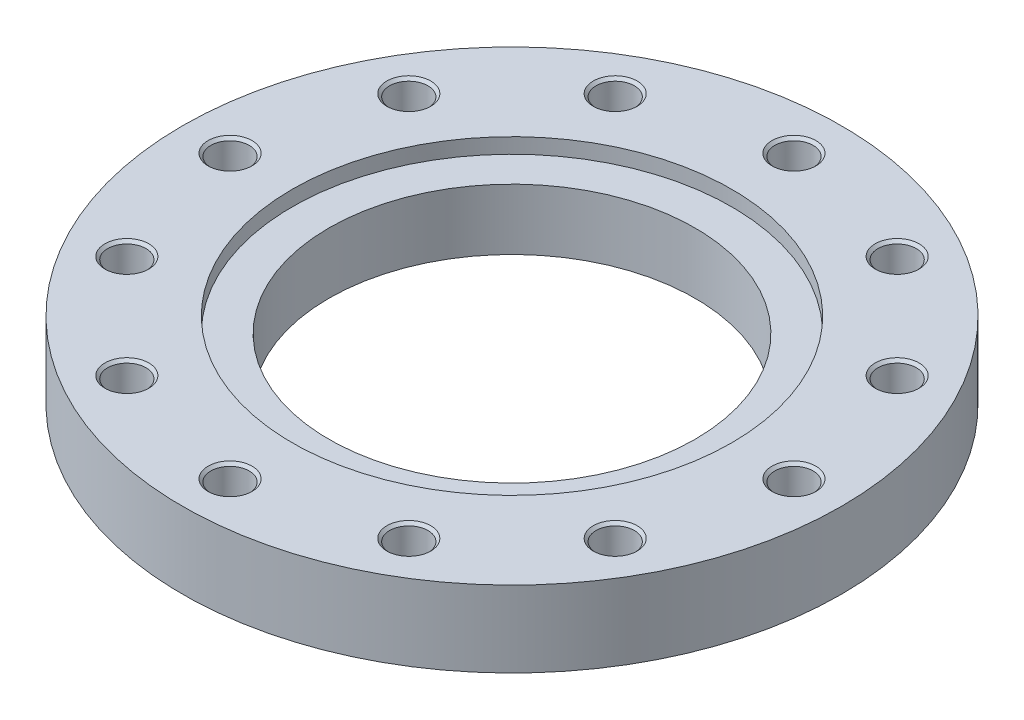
ISO-10303-21;
HEADER;
FILE_DESCRIPTION(('STEP AP214'),'2;1');
FILE_NAME('part.step','',(''),(''),'','','');
FILE_SCHEMA(('AUTOMOTIVE_DESIGN { 1 0 10303 214 1 1 1 1 }'));
ENDSEC;
DATA;
#1=APPLICATION_CONTEXT('core data for automotive mechanical design processes');
#2=APPLICATION_PROTOCOL_DEFINITION('international standard','automotive_design',2000,#1);
#3=PRODUCT_CONTEXT('',#1,'mechanical');
#4=PRODUCT('Part','Part','',(#3));
#5=PRODUCT_RELATED_PRODUCT_CATEGORY('part','',(#4));
#6=PRODUCT_DEFINITION_FORMATION('','',#4);
#7=PRODUCT_DEFINITION_CONTEXT('part definition',#1,'design');
#8=PRODUCT_DEFINITION('design','',#6,#7);
#9=PRODUCT_DEFINITION_SHAPE('','',#8);
#10=(LENGTH_UNIT() NAMED_UNIT(*) SI_UNIT(.MILLI.,.METRE.));
#11=(NAMED_UNIT(*) PLANE_ANGLE_UNIT() SI_UNIT($,.RADIAN.));
#12=(NAMED_UNIT(*) SI_UNIT($,.STERADIAN.) SOLID_ANGLE_UNIT());
#13=UNCERTAINTY_MEASURE_WITH_UNIT(LENGTH_MEASURE(1.E-05),#10,'distance_accuracy_value','');
#14=(GEOMETRIC_REPRESENTATION_CONTEXT(3) GLOBAL_UNCERTAINTY_ASSIGNED_CONTEXT((#13)) GLOBAL_UNIT_ASSIGNED_CONTEXT((#10,
#11,#12)) REPRESENTATION_CONTEXT('',''));
#15=CARTESIAN_POINT('',(0.,0.,0.));
#16=DIRECTION('',(0.,0.,1.));
#17=DIRECTION('',(1.,0.,0.));
#18=AXIS2_PLACEMENT_3D('',#15,#16,#17);
#19=CARTESIAN_POINT('',(0.,26.,0.));
#20=DIRECTION('',(0.,-1.,0.));
#21=DIRECTION('',(1.,0.,0.));
#22=AXIS2_PLACEMENT_3D('',#19,#20,#21);
#23=CYLINDRICAL_SURFACE('',#22,225.);
#24=CARTESIAN_POINT('',(0.,0.,0.));
#25=DIRECTION('',(0.,1.,0.));
#26=DIRECTION('',(1.,0.,0.));
#27=AXIS2_PLACEMENT_3D('',#24,#25,#26);
#28=CIRCLE('',#27,225.);
#29=CARTESIAN_POINT('',(225.,0.,0.));
#30=VERTEX_POINT('',#29);
#31=EDGE_CURVE('E9',#30,#30,#28,.T.);
#32=ORIENTED_EDGE('',*,*,#31,.T.);
#33=EDGE_LOOP('',(#32));
#34=FACE_BOUND('',#33,.T.);
#35=CARTESIAN_POINT('',(0.,52.,0.));
#36=DIRECTION('',(0.,1.,0.));
#37=DIRECTION('',(1.,0.,0.));
#38=AXIS2_PLACEMENT_3D('',#35,#36,#37);
#39=CIRCLE('',#38,225.);
#40=CARTESIAN_POINT('',(225.,52.,0.));
#41=VERTEX_POINT('',#40);
#42=EDGE_CURVE('E19',#41,#41,#39,.T.);
#43=ORIENTED_EDGE('',*,*,#42,.F.);
#44=EDGE_LOOP('',(#43));
#45=FACE_BOUND('',#44,.T.);
#46=ADVANCED_FACE('F15',(#34,#45),#23,.T.);
#47=CARTESIAN_POINT('',(175.,0.,0.));
#48=DIRECTION('',(0.,-1.,0.));
#49=DIRECTION('',(-1.,0.,0.));
#50=AXIS2_PLACEMENT_3D('',#47,#48,#49);
#51=PLANE('',#50);
#52=CARTESIAN_POINT('',(0.,0.,0.));
#53=DIRECTION('',(0.,1.,0.));
#54=DIRECTION('',(1.,0.,0.));
#55=AXIS2_PLACEMENT_3D('',#52,#53,#54);
#56=CIRCLE('',#55,125.);
#57=CARTESIAN_POINT('',(125.,0.,0.));
#58=VERTEX_POINT('',#57);
#59=EDGE_CURVE('E25',#58,#58,#56,.T.);
#60=ORIENTED_EDGE('',*,*,#59,.T.);
#61=EDGE_LOOP('',(#60));
#62=FACE_BOUND('',#61,.T.);
#63=ORIENTED_EDGE('',*,*,#31,.F.);
#64=EDGE_LOOP('',(#63));
#65=FACE_BOUND('',#64,.T.);
#66=ADVANCED_FACE('F17',(#62,#65),#51,.T.);
#67=CARTESIAN_POINT('',(0.,26.,0.));
#68=DIRECTION('',(0.,-1.,0.));
#69=DIRECTION('',(1.,0.,0.));
#70=AXIS2_PLACEMENT_3D('',#67,#68,#69);
#71=CYLINDRICAL_SURFACE('',#70,125.);
#72=ORIENTED_EDGE('',*,*,#59,.F.);
#73=EDGE_LOOP('',(#72));
#74=FACE_BOUND('',#73,.T.);
#75=CARTESIAN_POINT('',(0.,41.6,0.));
#76=DIRECTION('',(0.,1.,0.));
#77=DIRECTION('',(1.,0.,0.));
#78=AXIS2_PLACEMENT_3D('',#75,#76,#77);
#79=CIRCLE('',#78,125.);
#80=CARTESIAN_POINT('',(-125.,41.6,0.));
#81=VERTEX_POINT('',#80);
#82=EDGE_CURVE('E159',#81,#81,#79,.T.);
#83=ORIENTED_EDGE('',*,*,#82,.T.);
#84=EDGE_LOOP('',(#83));
#85=FACE_BOUND('',#84,.T.);
#86=ADVANCED_FACE('F564',(#74,#85),#71,.F.);
#87=CARTESIAN_POINT('',(175.,52.,0.));
#88=DIRECTION('',(0.,1.,0.));
#89=DIRECTION('',(1.,0.,0.));
#90=AXIS2_PLACEMENT_3D('',#87,#88,#89);
#91=PLANE('',#90);
#92=ORIENTED_EDGE('',*,*,#42,.T.);
#93=EDGE_LOOP('',(#92));
#94=FACE_BOUND('',#93,.T.);
#95=CARTESIAN_POINT('',(0.,52.,0.));
#96=DIRECTION('',(0.,-1.,0.));
#97=DIRECTION('',(1.,0.,0.));
#98=AXIS2_PLACEMENT_3D('',#95,#96,#97);
#99=CIRCLE('',#98,150.);
#100=CARTESIAN_POINT('',(-150.,52.,0.));
#101=VERTEX_POINT('',#100);
#102=EDGE_CURVE('E228',#101,#101,#99,.T.);
#103=ORIENTED_EDGE('',*,*,#102,.T.);
#104=EDGE_LOOP('',(#103));
#105=FACE_BOUND('',#104,.T.);
#106=CARTESIAN_POINT('',(192.5,52.,0.));
#107=DIRECTION('',(0.,-1.,0.));
#108=DIRECTION('',(1.,0.,0.));
#109=AXIS2_PLACEMENT_3D('',#106,#107,#108);
#110=CIRCLE('',#109,15.);
#111=CARTESIAN_POINT('',(207.5,52.,0.));
#112=VERTEX_POINT('',#111);
#113=EDGE_CURVE('E269',#112,#112,#110,.T.);
#114=ORIENTED_EDGE('',*,*,#113,.T.);
#115=EDGE_LOOP('',(#114));
#116=FACE_BOUND('',#115,.T.);
#117=CARTESIAN_POINT('',(166.709890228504,52.,-96.25));
#118=DIRECTION('',(0.,-1.,0.));
#119=DIRECTION('',(0.866025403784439,0.,-0.5));
#120=AXIS2_PLACEMENT_3D('',#117,#118,#119);
#121=CIRCLE('',#120,15.);
#122=CARTESIAN_POINT('',(179.700271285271,52.,-103.75));
#123=VERTEX_POINT('',#122);
#124=EDGE_CURVE('E255',#123,#123,#121,.T.);
#125=ORIENTED_EDGE('',*,*,#124,.T.);
#126=EDGE_LOOP('',(#125));
#127=FACE_BOUND('',#126,.T.);
#128=CARTESIAN_POINT('',(96.25,52.,-166.709890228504));
#129=DIRECTION('',(0.,-1.,0.));
#130=DIRECTION('',(0.5,0.,-0.866025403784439));
#131=AXIS2_PLACEMENT_3D('',#128,#129,#130);
#132=CIRCLE('',#131,15.);
#133=CARTESIAN_POINT('',(103.75,52.,-179.700271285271));
#134=VERTEX_POINT('',#133);
#135=EDGE_CURVE('E243',#134,#134,#132,.T.);
#136=ORIENTED_EDGE('',*,*,#135,.T.);
#137=EDGE_LOOP('',(#136));
#138=FACE_BOUND('',#137,.T.);
#139=CARTESIAN_POINT('',(0.,52.,-192.5));
#140=DIRECTION('',(0.,-1.,0.));
#141=DIRECTION('',(0.,0.,-1.));
#142=AXIS2_PLACEMENT_3D('',#139,#140,#141);
#143=CIRCLE('',#142,15.);
#144=CARTESIAN_POINT('',(0.,52.,-207.5));
#145=VERTEX_POINT('',#144);
#146=EDGE_CURVE('E230',#145,#145,#143,.T.);
#147=ORIENTED_EDGE('',*,*,#146,.T.);
#148=EDGE_LOOP('',(#147));
#149=FACE_BOUND('',#148,.T.);
#150=CARTESIAN_POINT('',(-96.25,52.,-166.709890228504));
#151=DIRECTION('',(0.,-1.,0.));
#152=DIRECTION('',(-0.5,0.,-0.866025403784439));
#153=AXIS2_PLACEMENT_3D('',#150,#151,#152);
#154=CIRCLE('',#153,15.);
#155=CARTESIAN_POINT('',(-103.75,52.,-179.700271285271));
#156=VERTEX_POINT('',#155);
#157=EDGE_CURVE('E212',#156,#156,#154,.T.);
#158=ORIENTED_EDGE('',*,*,#157,.T.);
#159=EDGE_LOOP('',(#158));
#160=FACE_BOUND('',#159,.T.);
#161=CARTESIAN_POINT('',(-166.709890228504,52.,-96.25));
#162=DIRECTION('',(0.,-1.,0.));
#163=DIRECTION('',(-0.866025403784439,0.,-0.5));
#164=AXIS2_PLACEMENT_3D('',#161,#162,#163);
#165=CIRCLE('',#164,15.);
#166=CARTESIAN_POINT('',(-179.700271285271,52.,-103.75));
#167=VERTEX_POINT('',#166);
#168=EDGE_CURVE('E200',#167,#167,#165,.T.);
#169=ORIENTED_EDGE('',*,*,#168,.T.);
#170=EDGE_LOOP('',(#169));
#171=FACE_BOUND('',#170,.T.);
#172=CARTESIAN_POINT('',(-192.5,52.,0.));
#173=DIRECTION('',(0.,-1.,0.));
#174=DIRECTION('',(-1.,0.,0.));
#175=AXIS2_PLACEMENT_3D('',#172,#173,#174);
#176=CIRCLE('',#175,15.);
#177=CARTESIAN_POINT('',(-207.5,52.,0.));
#178=VERTEX_POINT('',#177);
#179=EDGE_CURVE('E180',#178,#178,#176,.T.);
#180=ORIENTED_EDGE('',*,*,#179,.T.);
#181=EDGE_LOOP('',(#180));
#182=FACE_BOUND('',#181,.T.);
#183=CARTESIAN_POINT('',(-166.709890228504,52.,96.25));
#184=DIRECTION('',(0.,-1.,0.));
#185=DIRECTION('',(-0.866025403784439,0.,0.5));
#186=AXIS2_PLACEMENT_3D('',#183,#184,#185);
#187=CIRCLE('',#186,15.);
#188=CARTESIAN_POINT('',(-179.700271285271,52.,103.75));
#189=VERTEX_POINT('',#188);
#190=EDGE_CURVE('E297',#189,#189,#187,.T.);
#191=ORIENTED_EDGE('',*,*,#190,.T.);
#192=EDGE_LOOP('',(#191));
#193=FACE_BOUND('',#192,.T.);
#194=CARTESIAN_POINT('',(-96.25,52.,166.709890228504));
#195=DIRECTION('',(0.,-1.,0.));
#196=DIRECTION('',(-0.5,0.,0.866025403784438));
#197=AXIS2_PLACEMENT_3D('',#194,#195,#196);
#198=CIRCLE('',#197,15.);
#199=CARTESIAN_POINT('',(-103.75,52.,179.700271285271));
#200=VERTEX_POINT('',#199);
#201=EDGE_CURVE('E319',#200,#200,#198,.T.);
#202=ORIENTED_EDGE('',*,*,#201,.T.);
#203=EDGE_LOOP('',(#202));
#204=FACE_BOUND('',#203,.T.);
#205=CARTESIAN_POINT('',(0.,52.,192.5));
#206=DIRECTION('',(0.,-1.,0.));
#207=DIRECTION('',(0.,0.,1.));
#208=AXIS2_PLACEMENT_3D('',#205,#206,#207);
#209=CIRCLE('',#208,15.);
#210=CARTESIAN_POINT('',(0.,52.,207.5));
#211=VERTEX_POINT('',#210);
#212=EDGE_CURVE('E340',#211,#211,#209,.T.);
#213=ORIENTED_EDGE('',*,*,#212,.T.);
#214=EDGE_LOOP('',(#213));
#215=FACE_BOUND('',#214,.T.);
#216=CARTESIAN_POINT('',(96.25,52.,166.709890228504));
#217=DIRECTION('',(0.,-1.,0.));
#218=DIRECTION('',(0.5,0.,0.866025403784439));
#219=AXIS2_PLACEMENT_3D('',#216,#217,#218);
#220=CIRCLE('',#219,15.);
#221=CARTESIAN_POINT('',(103.75,52.,179.700271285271));
#222=VERTEX_POINT('',#221);
#223=EDGE_CURVE('E350',#222,#222,#220,.T.);
#224=ORIENTED_EDGE('',*,*,#223,.T.);
#225=EDGE_LOOP('',(#224));
#226=FACE_BOUND('',#225,.T.);
#227=CARTESIAN_POINT('',(166.709890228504,52.,96.25));
#228=DIRECTION('',(0.,-1.,0.));
#229=DIRECTION('',(0.866025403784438,0.,0.5));
#230=AXIS2_PLACEMENT_3D('',#227,#228,#229);
#231=CIRCLE('',#230,15.);
#232=CARTESIAN_POINT('',(179.700271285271,52.,103.75));
#233=VERTEX_POINT('',#232);
#234=EDGE_CURVE('E366',#233,#233,#231,.T.);
#235=ORIENTED_EDGE('',*,*,#234,.T.);
#236=EDGE_LOOP('',(#235));
#237=FACE_BOUND('',#236,.T.);
#238=ADVANCED_FACE('F387',(#94,#105,#116,#127,#138,#149,#160,#171,#182,#193,#204,#215,#226,
#237),#91,.T.);
#239=CARTESIAN_POINT('',(0.,41.6,0.));
#240=DIRECTION('',(0.,-1.,0.));
#241=DIRECTION('',(-1.,0.,0.));
#242=AXIS2_PLACEMENT_3D('',#239,#240,#241);
#243=PLANE('',#242);
#244=CARTESIAN_POINT('',(0.,41.6,0.));
#245=DIRECTION('',(0.,-1.,0.));
#246=DIRECTION('',(1.,0.,0.));
#247=AXIS2_PLACEMENT_3D('',#244,#245,#246);
#248=CIRCLE('',#247,150.);
#249=CARTESIAN_POINT('',(150.,41.6,0.));
#250=VERTEX_POINT('',#249);
#251=EDGE_CURVE('E164',#250,#250,#248,.T.);
#252=ORIENTED_EDGE('',*,*,#251,.F.);
#253=EDGE_LOOP('',(#252));
#254=FACE_BOUND('',#253,.T.);
#255=ORIENTED_EDGE('',*,*,#82,.F.);
#256=EDGE_LOOP('',(#255));
#257=FACE_BOUND('',#256,.T.);
#258=ADVANCED_FACE('F655',(#254,#257),#243,.F.);
#259=CARTESIAN_POINT('',(0.,49.4,0.));
#260=DIRECTION('',(0.,-1.,0.));
#261=DIRECTION('',(1.,0.,0.));
#262=AXIS2_PLACEMENT_3D('',#259,#260,#261);
#263=CYLINDRICAL_SURFACE('',#262,150.);
#264=ORIENTED_EDGE('',*,*,#251,.T.);
#265=EDGE_LOOP('',(#264));
#266=FACE_BOUND('',#265,.T.);
#267=ORIENTED_EDGE('',*,*,#102,.F.);
#268=EDGE_LOOP('',(#267));
#269=FACE_BOUND('',#268,.T.);
#270=ADVANCED_FACE('F657',(#266,#269),#263,.F.);
#271=CARTESIAN_POINT('',(192.5,8.21673193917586,0.));
#272=DIRECTION('',(0.,1.,0.));
#273=DIRECTION('',(1.,0.,0.));
#274=AXIS2_PLACEMENT_3D('',#271,#272,#273);
#275=CONICAL_SURFACE('',#274,6.5528125,1.0471975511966);
#276=CARTESIAN_POINT('',(192.5,12.,0.));
#277=DIRECTION('',(0.,-1.,0.));
#278=DIRECTION('',(1.,0.,0.));
#279=AXIS2_PLACEMENT_3D('',#276,#277,#278);
#280=CIRCLE('',#279,13.105625);
#281=CARTESIAN_POINT('',(205.605625,12.,0.));
#282=VERTEX_POINT('',#281);
#283=EDGE_CURVE('E241',#282,#282,#280,.T.);
#284=ORIENTED_EDGE('',*,*,#283,.F.);
#285=EDGE_LOOP('',(#284));
#286=FACE_BOUND('',#285,.T.);
#287=CARTESIAN_POINT('',(192.5,4.43346387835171,0.));
#288=VERTEX_POINT('',#287);
#289=VERTEX_LOOP('',#288);
#290=FACE_BOUND('',#289,.T.);
#291=ADVANCED_FACE('F653',(#286,#290),#275,.F.);
#292=CARTESIAN_POINT('',(192.5,16.0528125,0.));
#293=DIRECTION('',(0.,1.,0.));
#294=DIRECTION('',(1.,0.,0.));
#295=AXIS2_PLACEMENT_3D('',#292,#293,#294);
#296=CYLINDRICAL_SURFACE('',#295,13.105625);
#297=CARTESIAN_POINT('',(192.5,20.105625,0.));
#298=DIRECTION('',(0.,-1.,0.));
#299=DIRECTION('',(1.,0.,0.));
#300=AXIS2_PLACEMENT_3D('',#297,#298,#299);
#301=CIRCLE('',#300,13.105625);
#302=CARTESIAN_POINT('',(205.605625,20.105625,0.));
#303=VERTEX_POINT('',#302);
#304=EDGE_CURVE('E215',#303,#303,#301,.T.);
#305=ORIENTED_EDGE('',*,*,#304,.F.);
#306=EDGE_LOOP('',(#305));
#307=FACE_BOUND('',#306,.T.);
#308=ORIENTED_EDGE('',*,*,#283,.T.);
#309=EDGE_LOOP('',(#308));
#310=FACE_BOUND('',#309,.T.);
#311=ADVANCED_FACE('F635',(#307,#310),#296,.F.);
#312=CARTESIAN_POINT('',(192.5,21.0528125,0.));
#313=DIRECTION('',(0.,1.,0.));
#314=DIRECTION('',(1.,0.,0.));
#315=AXIS2_PLACEMENT_3D('',#312,#313,#314);
#316=CONICAL_SURFACE('',#315,14.0528125,0.785398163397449);
#317=CARTESIAN_POINT('',(192.5,22.,0.));
#318=DIRECTION('',(0.,-1.,0.));
#319=DIRECTION('',(1.,0.,0.));
#320=AXIS2_PLACEMENT_3D('',#317,#318,#319);
#321=CIRCLE('',#320,15.);
#322=CARTESIAN_POINT('',(207.5,22.,0.));
#323=VERTEX_POINT('',#322);
#324=EDGE_CURVE('E213',#323,#323,#321,.T.);
#325=ORIENTED_EDGE('',*,*,#324,.F.);
#326=EDGE_LOOP('',(#325));
#327=FACE_BOUND('',#326,.T.);
#328=ORIENTED_EDGE('',*,*,#304,.T.);
#329=EDGE_LOOP('',(#328));
#330=FACE_BOUND('',#329,.T.);
#331=ADVANCED_FACE('F631',(#327,#330),#316,.F.);
#332=CARTESIAN_POINT('',(206.5528125,22.,0.));
#333=DIRECTION('',(0.,1.,0.));
#334=DIRECTION('',(-1.,0.,0.));
#335=AXIS2_PLACEMENT_3D('',#332,#333,#334);
#336=PLANE('',#335);
#337=CARTESIAN_POINT('',(192.5,22.,0.));
#338=DIRECTION('',(0.,-1.,0.));
#339=DIRECTION('',(1.,0.,0.));
#340=AXIS2_PLACEMENT_3D('',#337,#338,#339);
#341=CIRCLE('',#340,13.105625);
#342=CARTESIAN_POINT('',(205.605625,22.,0.));
#343=VERTEX_POINT('',#342);
#344=EDGE_CURVE('E216',#343,#343,#341,.T.);
#345=ORIENTED_EDGE('',*,*,#344,.F.);
#346=EDGE_LOOP('',(#345));
#347=FACE_BOUND('',#346,.T.);
#348=ORIENTED_EDGE('',*,*,#324,.T.);
#349=EDGE_LOOP('',(#348));
#350=FACE_BOUND('',#349,.T.);
#351=ADVANCED_FACE('F634',(#347,#350),#336,.F.);
#352=CARTESIAN_POINT('',(192.5,36.0528125,0.));
#353=DIRECTION('',(0.,1.,0.));
#354=DIRECTION('',(1.,0.,0.));
#355=AXIS2_PLACEMENT_3D('',#352,#353,#354);
#356=CYLINDRICAL_SURFACE('',#355,13.105625);
#357=CARTESIAN_POINT('',(192.5,50.105625,0.));
#358=DIRECTION('',(0.,-1.,0.));
#359=DIRECTION('',(1.,0.,0.));
#360=AXIS2_PLACEMENT_3D('',#357,#358,#359);
#361=CIRCLE('',#360,13.105625);
#362=CARTESIAN_POINT('',(205.605625,50.105625,0.));
#363=VERTEX_POINT('',#362);
#364=EDGE_CURVE('E266',#363,#363,#361,.T.);
#365=ORIENTED_EDGE('',*,*,#364,.F.);
#366=EDGE_LOOP('',(#365));
#367=FACE_BOUND('',#366,.T.);
#368=ORIENTED_EDGE('',*,*,#344,.T.);
#369=EDGE_LOOP('',(#368));
#370=FACE_BOUND('',#369,.T.);
#371=ADVANCED_FACE('F647',(#367,#370),#356,.F.);
#372=CARTESIAN_POINT('',(192.5,51.0528125,0.));
#373=DIRECTION('',(0.,1.,0.));
#374=DIRECTION('',(1.,0.,0.));
#375=AXIS2_PLACEMENT_3D('',#372,#373,#374);
#376=CONICAL_SURFACE('',#375,14.0528125,0.785398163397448);
#377=ORIENTED_EDGE('',*,*,#113,.F.);
#378=EDGE_LOOP('',(#377));
#379=FACE_BOUND('',#378,.T.);
#380=ORIENTED_EDGE('',*,*,#364,.T.);
#381=EDGE_LOOP('',(#380));
#382=FACE_BOUND('',#381,.T.);
#383=ADVANCED_FACE('F499',(#379,#382),#376,.F.);
#384=CARTESIAN_POINT('',(166.709890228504,8.21673193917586,-96.25));
#385=DIRECTION('',(0.,1.,0.));
#386=DIRECTION('',(0.866025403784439,0.,-0.5));
#387=AXIS2_PLACEMENT_3D('',#384,#385,#386);
#388=CONICAL_SURFACE('',#387,6.5528125,1.0471975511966);
#389=CARTESIAN_POINT('',(166.709890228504,12.,-96.25));
#390=DIRECTION('',(0.,-1.,0.));
#391=DIRECTION('',(0.866025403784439,0.,-0.5));
#392=AXIS2_PLACEMENT_3D('',#389,#390,#391);
#393=CIRCLE('',#392,13.105625);
#394=CARTESIAN_POINT('',(178.059694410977,12.,-102.8028125));
#395=VERTEX_POINT('',#394);
#396=EDGE_CURVE('E264',#395,#395,#393,.T.);
#397=ORIENTED_EDGE('',*,*,#396,.F.);
#398=EDGE_LOOP('',(#397));
#399=FACE_BOUND('',#398,.T.);
#400=CARTESIAN_POINT('',(166.709890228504,4.43346387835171,-96.25));
#401=VERTEX_POINT('',#400);
#402=VERTEX_LOOP('',#401);
#403=FACE_BOUND('',#402,.T.);
#404=ADVANCED_FACE('F493',(#399,#403),#388,.F.);
#405=CARTESIAN_POINT('',(166.709890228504,16.0528125,-96.25));
#406=DIRECTION('',(0.,1.,0.));
#407=DIRECTION('',(0.866025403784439,0.,-0.5));
#408=AXIS2_PLACEMENT_3D('',#405,#406,#407);
#409=CYLINDRICAL_SURFACE('',#408,13.105625);
#410=CARTESIAN_POINT('',(166.709890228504,20.105625,-96.25));
#411=DIRECTION('',(0.,-1.,0.));
#412=DIRECTION('',(0.866025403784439,0.,-0.5));
#413=AXIS2_PLACEMENT_3D('',#410,#411,#412);
#414=CIRCLE('',#413,13.105625);
#415=CARTESIAN_POINT('',(178.059694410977,20.105625,-102.8028125));
#416=VERTEX_POINT('',#415);
#417=EDGE_CURVE('E261',#416,#416,#414,.T.);
#418=ORIENTED_EDGE('',*,*,#417,.F.);
#419=EDGE_LOOP('',(#418));
#420=FACE_BOUND('',#419,.T.);
#421=ORIENTED_EDGE('',*,*,#396,.T.);
#422=EDGE_LOOP('',(#421));
#423=FACE_BOUND('',#422,.T.);
#424=ADVANCED_FACE('F490',(#420,#423),#409,.F.);
#425=CARTESIAN_POINT('',(166.709890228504,21.0528125,-96.25));
#426=DIRECTION('',(0.,1.,0.));
#427=DIRECTION('',(0.866025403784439,0.,-0.5));
#428=AXIS2_PLACEMENT_3D('',#425,#426,#427);
#429=CONICAL_SURFACE('',#428,14.0528125,0.785398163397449);
#430=CARTESIAN_POINT('',(166.709890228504,22.,-96.25));
#431=DIRECTION('',(0.,-1.,0.));
#432=DIRECTION('',(0.866025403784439,0.,-0.5));
#433=AXIS2_PLACEMENT_3D('',#430,#431,#432);
#434=CIRCLE('',#433,15.);
#435=CARTESIAN_POINT('',(179.700271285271,22.,-103.75));
#436=VERTEX_POINT('',#435);
#437=EDGE_CURVE('E259',#436,#436,#434,.T.);
#438=ORIENTED_EDGE('',*,*,#437,.F.);
#439=EDGE_LOOP('',(#438));
#440=FACE_BOUND('',#439,.T.);
#441=ORIENTED_EDGE('',*,*,#417,.T.);
#442=EDGE_LOOP('',(#441));
#443=FACE_BOUND('',#442,.T.);
#444=ADVANCED_FACE('F488',(#440,#443),#429,.F.);
#445=CARTESIAN_POINT('',(178.879982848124,22.,-103.27640625));
#446=DIRECTION('',(0.,1.,0.));
#447=DIRECTION('',(-0.866025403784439,0.,0.5));
#448=AXIS2_PLACEMENT_3D('',#445,#446,#447);
#449=PLANE('',#448);
#450=CARTESIAN_POINT('',(166.709890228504,22.,-96.25));
#451=DIRECTION('',(0.,-1.,0.));
#452=DIRECTION('',(0.866025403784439,0.,-0.5));
#453=AXIS2_PLACEMENT_3D('',#450,#451,#452);
#454=CIRCLE('',#453,13.105625);
#455=CARTESIAN_POINT('',(178.059694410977,22.,-102.8028125));
#456=VERTEX_POINT('',#455);
#457=EDGE_CURVE('E258',#456,#456,#454,.T.);
#458=ORIENTED_EDGE('',*,*,#457,.F.);
#459=EDGE_LOOP('',(#458));
#460=FACE_BOUND('',#459,.T.);
#461=ORIENTED_EDGE('',*,*,#437,.T.);
#462=EDGE_LOOP('',(#461));
#463=FACE_BOUND('',#462,.T.);
#464=ADVANCED_FACE('F639',(#460,#463),#449,.F.);
#465=CARTESIAN_POINT('',(166.709890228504,36.0528125,-96.25));
#466=DIRECTION('',(0.,1.,0.));
#467=DIRECTION('',(0.866025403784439,0.,-0.5));
#468=AXIS2_PLACEMENT_3D('',#465,#466,#467);
#469=CYLINDRICAL_SURFACE('',#468,13.105625);
#470=CARTESIAN_POINT('',(166.709890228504,50.105625,-96.25));
#471=DIRECTION('',(0.,-1.,0.));
#472=DIRECTION('',(0.866025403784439,0.,-0.5));
#473=AXIS2_PLACEMENT_3D('',#470,#471,#472);
#474=CIRCLE('',#473,13.105625);
#475=CARTESIAN_POINT('',(178.059694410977,50.105625,-102.8028125));
#476=VERTEX_POINT('',#475);
#477=EDGE_CURVE('E253',#476,#476,#474,.T.);
#478=ORIENTED_EDGE('',*,*,#477,.F.);
#479=EDGE_LOOP('',(#478));
#480=FACE_BOUND('',#479,.T.);
#481=ORIENTED_EDGE('',*,*,#457,.T.);
#482=EDGE_LOOP('',(#481));
#483=FACE_BOUND('',#482,.T.);
#484=ADVANCED_FACE('F629',(#480,#483),#469,.F.);
#485=CARTESIAN_POINT('',(166.709890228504,51.0528125,-96.25));
#486=DIRECTION('',(0.,1.,0.));
#487=DIRECTION('',(0.866025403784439,0.,-0.5));
#488=AXIS2_PLACEMENT_3D('',#485,#486,#487);
#489=CONICAL_SURFACE('',#488,14.0528125,0.785398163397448);
#490=ORIENTED_EDGE('',*,*,#124,.F.);
#491=EDGE_LOOP('',(#490));
#492=FACE_BOUND('',#491,.T.);
#493=ORIENTED_EDGE('',*,*,#477,.T.);
#494=EDGE_LOOP('',(#493));
#495=FACE_BOUND('',#494,.T.);
#496=ADVANCED_FACE('F625',(#492,#495),#489,.F.);
#497=CARTESIAN_POINT('',(96.25,8.21673193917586,-166.709890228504));
#498=DIRECTION('',(0.,1.,0.));
#499=DIRECTION('',(0.5,0.,-0.866025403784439));
#500=AXIS2_PLACEMENT_3D('',#497,#498,#499);
#501=CONICAL_SURFACE('',#500,6.5528125,1.0471975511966);
#502=CARTESIAN_POINT('',(96.25,12.,-166.709890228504));
#503=DIRECTION('',(0.,-1.,0.));
#504=DIRECTION('',(0.5,0.,-0.866025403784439));
#505=AXIS2_PLACEMENT_3D('',#502,#503,#504);
#506=CIRCLE('',#505,13.105625);
#507=CARTESIAN_POINT('',(102.8028125,12.,-178.059694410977));
#508=VERTEX_POINT('',#507);
#509=EDGE_CURVE('E252',#508,#508,#506,.T.);
#510=ORIENTED_EDGE('',*,*,#509,.F.);
#511=EDGE_LOOP('',(#510));
#512=FACE_BOUND('',#511,.T.);
#513=CARTESIAN_POINT('',(96.25,4.43346387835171,-166.709890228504));
#514=VERTEX_POINT('',#513);
#515=VERTEX_LOOP('',#514);
#516=FACE_BOUND('',#515,.T.);
#517=ADVANCED_FACE('F621',(#512,#516),#501,.F.);
#518=CARTESIAN_POINT('',(96.25,16.0528125,-166.709890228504));
#519=DIRECTION('',(0.,1.,0.));
#520=DIRECTION('',(0.5,0.,-0.866025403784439));
#521=AXIS2_PLACEMENT_3D('',#518,#519,#520);
#522=CYLINDRICAL_SURFACE('',#521,13.105625);
#523=CARTESIAN_POINT('',(96.25,20.105625,-166.709890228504));
#524=DIRECTION('',(0.,-1.,0.));
#525=DIRECTION('',(0.5,0.,-0.866025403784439));
#526=AXIS2_PLACEMENT_3D('',#523,#524,#525);
#527=CIRCLE('',#526,13.105625);
#528=CARTESIAN_POINT('',(102.8028125,20.105625,-178.059694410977));
#529=VERTEX_POINT('',#528);
#530=EDGE_CURVE('E250',#529,#529,#527,.T.);
#531=ORIENTED_EDGE('',*,*,#530,.F.);
#532=EDGE_LOOP('',(#531));
#533=FACE_BOUND('',#532,.T.);
#534=ORIENTED_EDGE('',*,*,#509,.T.);
#535=EDGE_LOOP('',(#534));
#536=FACE_BOUND('',#535,.T.);
#537=ADVANCED_FACE('F618',(#533,#536),#522,.F.);
#538=CARTESIAN_POINT('',(96.25,21.0528125,-166.709890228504));
#539=DIRECTION('',(0.,1.,0.));
#540=DIRECTION('',(0.5,0.,-0.866025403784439));
#541=AXIS2_PLACEMENT_3D('',#538,#539,#540);
#542=CONICAL_SURFACE('',#541,14.0528125,0.785398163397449);
#543=CARTESIAN_POINT('',(96.25,22.,-166.709890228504));
#544=DIRECTION('',(0.,-1.,0.));
#545=DIRECTION('',(0.5,0.,-0.866025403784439));
#546=AXIS2_PLACEMENT_3D('',#543,#544,#545);
#547=CIRCLE('',#546,15.);
#548=CARTESIAN_POINT('',(103.75,22.,-179.700271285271));
#549=VERTEX_POINT('',#548);
#550=EDGE_CURVE('E248',#549,#549,#547,.T.);
#551=ORIENTED_EDGE('',*,*,#550,.F.);
#552=EDGE_LOOP('',(#551));
#553=FACE_BOUND('',#552,.T.);
#554=ORIENTED_EDGE('',*,*,#530,.T.);
#555=EDGE_LOOP('',(#554));
#556=FACE_BOUND('',#555,.T.);
#557=ADVANCED_FACE('F616',(#553,#556),#542,.F.);
#558=CARTESIAN_POINT('',(103.27640625,22.,-178.879982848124));
#559=DIRECTION('',(0.,1.,0.));
#560=DIRECTION('',(-0.5,0.,0.866025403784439));
#561=AXIS2_PLACEMENT_3D('',#558,#559,#560);
#562=PLANE('',#561);
#563=CARTESIAN_POINT('',(96.25,22.,-166.709890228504));
#564=DIRECTION('',(0.,-1.,0.));
#565=DIRECTION('',(0.5,0.,-0.866025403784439));
#566=AXIS2_PLACEMENT_3D('',#563,#564,#565);
#567=CIRCLE('',#566,13.105625);
#568=CARTESIAN_POINT('',(102.8028125,22.,-178.059694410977));
#569=VERTEX_POINT('',#568);
#570=EDGE_CURVE('E246',#569,#569,#567,.T.);
#571=ORIENTED_EDGE('',*,*,#570,.F.);
#572=EDGE_LOOP('',(#571));
#573=FACE_BOUND('',#572,.T.);
#574=ORIENTED_EDGE('',*,*,#550,.T.);
#575=EDGE_LOOP('',(#574));
#576=FACE_BOUND('',#575,.T.);
#577=ADVANCED_FACE('F612',(#573,#576),#562,.F.);
#578=CARTESIAN_POINT('',(96.25,36.0528125,-166.709890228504));
#579=DIRECTION('',(0.,1.,0.));
#580=DIRECTION('',(0.5,0.,-0.866025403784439));
#581=AXIS2_PLACEMENT_3D('',#578,#579,#580);
#582=CYLINDRICAL_SURFACE('',#581,13.105625);
#583=CARTESIAN_POINT('',(96.25,50.105625,-166.709890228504));
#584=DIRECTION('',(0.,-1.,0.));
#585=DIRECTION('',(0.5,0.,-0.866025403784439));
#586=AXIS2_PLACEMENT_3D('',#583,#584,#585);
#587=CIRCLE('',#586,13.105625);
#588=CARTESIAN_POINT('',(102.8028125,50.105625,-178.059694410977));
#589=VERTEX_POINT('',#588);
#590=EDGE_CURVE('E240',#589,#589,#587,.T.);
#591=ORIENTED_EDGE('',*,*,#590,.F.);
#592=EDGE_LOOP('',(#591));
#593=FACE_BOUND('',#592,.T.);
#594=ORIENTED_EDGE('',*,*,#570,.T.);
#595=EDGE_LOOP('',(#594));
#596=FACE_BOUND('',#595,.T.);
#597=ADVANCED_FACE('F607',(#593,#596),#582,.F.);
#598=CARTESIAN_POINT('',(96.25,51.0528125,-166.709890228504));
#599=DIRECTION('',(0.,1.,0.));
#600=DIRECTION('',(0.5,0.,-0.866025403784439));
#601=AXIS2_PLACEMENT_3D('',#598,#599,#600);
#602=CONICAL_SURFACE('',#601,14.0528125,0.785398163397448);
#603=ORIENTED_EDGE('',*,*,#135,.F.);
#604=EDGE_LOOP('',(#603));
#605=FACE_BOUND('',#604,.T.);
#606=ORIENTED_EDGE('',*,*,#590,.T.);
#607=EDGE_LOOP('',(#606));
#608=FACE_BOUND('',#607,.T.);
#609=ADVANCED_FACE('F604',(#605,#608),#602,.F.);
#610=CARTESIAN_POINT('',(0.,8.21673193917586,-192.5));
#611=DIRECTION('',(0.,1.,0.));
#612=DIRECTION('',(0.,0.,-1.));
#613=AXIS2_PLACEMENT_3D('',#610,#611,#612);
#614=CONICAL_SURFACE('',#613,6.5528125,1.0471975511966);
#615=CARTESIAN_POINT('',(0.,12.,-192.5));
#616=DIRECTION('',(0.,-1.,0.));
#617=DIRECTION('',(0.,0.,-1.));
#618=AXIS2_PLACEMENT_3D('',#615,#616,#617);
#619=CIRCLE('',#618,13.105625);
#620=CARTESIAN_POINT('',(0.,12.,-205.605625));
#621=VERTEX_POINT('',#620);
#622=EDGE_CURVE('E238',#621,#621,#619,.T.);
#623=ORIENTED_EDGE('',*,*,#622,.F.);
#624=EDGE_LOOP('',(#623));
#625=FACE_BOUND('',#624,.T.);
#626=CARTESIAN_POINT('',(0.,4.43346387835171,-192.5));
#627=VERTEX_POINT('',#626);
#628=VERTEX_LOOP('',#627);
#629=FACE_BOUND('',#628,.T.);
#630=ADVANCED_FACE('F606',(#625,#629),#614,.F.);
#631=CARTESIAN_POINT('',(0.,16.0528125,-192.5));
#632=DIRECTION('',(0.,1.,0.));
#633=DIRECTION('',(0.,0.,-1.));
#634=AXIS2_PLACEMENT_3D('',#631,#632,#633);
#635=CYLINDRICAL_SURFACE('',#634,13.105625);
#636=CARTESIAN_POINT('',(0.,20.105625,-192.5));
#637=DIRECTION('',(0.,-1.,0.));
#638=DIRECTION('',(0.,0.,-1.));
#639=AXIS2_PLACEMENT_3D('',#636,#637,#638);
#640=CIRCLE('',#639,13.105625);
#641=CARTESIAN_POINT('',(0.,20.105625,-205.605625));
#642=VERTEX_POINT('',#641);
#643=EDGE_CURVE('E235',#642,#642,#640,.T.);
#644=ORIENTED_EDGE('',*,*,#643,.F.);
#645=EDGE_LOOP('',(#644));
#646=FACE_BOUND('',#645,.T.);
#647=ORIENTED_EDGE('',*,*,#622,.T.);
#648=EDGE_LOOP('',(#647));
#649=FACE_BOUND('',#648,.T.);
#650=ADVANCED_FACE('F602',(#646,#649),#635,.F.);
#651=CARTESIAN_POINT('',(0.,21.0528125,-192.5));
#652=DIRECTION('',(0.,1.,0.));
#653=DIRECTION('',(0.,0.,-1.));
#654=AXIS2_PLACEMENT_3D('',#651,#652,#653);
#655=CONICAL_SURFACE('',#654,14.0528125,0.785398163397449);
#656=CARTESIAN_POINT('',(0.,22.,-192.5));
#657=DIRECTION('',(0.,-1.,0.));
#658=DIRECTION('',(0.,0.,-1.));
#659=AXIS2_PLACEMENT_3D('',#656,#657,#658);
#660=CIRCLE('',#659,15.);
#661=CARTESIAN_POINT('',(0.,22.,-207.5));
#662=VERTEX_POINT('',#661);
#663=EDGE_CURVE('E233',#662,#662,#660,.T.);
#664=ORIENTED_EDGE('',*,*,#663,.F.);
#665=EDGE_LOOP('',(#664));
#666=FACE_BOUND('',#665,.T.);
#667=ORIENTED_EDGE('',*,*,#643,.T.);
#668=EDGE_LOOP('',(#667));
#669=FACE_BOUND('',#668,.T.);
#670=ADVANCED_FACE('F598',(#666,#669),#655,.F.);
#671=CARTESIAN_POINT('',(0.,22.,-206.5528125));
#672=DIRECTION('',(0.,1.,0.));
#673=DIRECTION('',(0.,0.,1.));
#674=AXIS2_PLACEMENT_3D('',#671,#672,#673);
#675=PLANE('',#674);
#676=CARTESIAN_POINT('',(0.,22.,-192.5));
#677=DIRECTION('',(0.,-1.,0.));
#678=DIRECTION('',(0.,0.,-1.));
#679=AXIS2_PLACEMENT_3D('',#676,#677,#678);
#680=CIRCLE('',#679,13.105625);
#681=CARTESIAN_POINT('',(0.,22.,-205.605625));
#682=VERTEX_POINT('',#681);
#683=EDGE_CURVE('E232',#682,#682,#680,.T.);
#684=ORIENTED_EDGE('',*,*,#683,.F.);
#685=EDGE_LOOP('',(#684));
#686=FACE_BOUND('',#685,.T.);
#687=ORIENTED_EDGE('',*,*,#663,.T.);
#688=EDGE_LOOP('',(#687));
#689=FACE_BOUND('',#688,.T.);
#690=ADVANCED_FACE('F594',(#686,#689),#675,.F.);
#691=CARTESIAN_POINT('',(0.,36.0528125,-192.5));
#692=DIRECTION('',(0.,1.,0.));
#693=DIRECTION('',(0.,0.,-1.));
#694=AXIS2_PLACEMENT_3D('',#691,#692,#693);
#695=CYLINDRICAL_SURFACE('',#694,13.105625);
#696=CARTESIAN_POINT('',(0.,50.105625,-192.5));
#697=DIRECTION('',(0.,-1.,0.));
#698=DIRECTION('',(0.,0.,-1.));
#699=AXIS2_PLACEMENT_3D('',#696,#697,#698);
#700=CIRCLE('',#699,13.105625);
#701=CARTESIAN_POINT('',(0.,50.105625,-205.605625));
#702=VERTEX_POINT('',#701);
#703=EDGE_CURVE('E226',#702,#702,#700,.T.);
#704=ORIENTED_EDGE('',*,*,#703,.F.);
#705=EDGE_LOOP('',(#704));
#706=FACE_BOUND('',#705,.T.);
#707=ORIENTED_EDGE('',*,*,#683,.T.);
#708=EDGE_LOOP('',(#707));
#709=FACE_BOUND('',#708,.T.);
#710=ADVANCED_FACE('F590',(#706,#709),#695,.F.);
#711=CARTESIAN_POINT('',(0.,51.0528125,-192.5));
#712=DIRECTION('',(0.,1.,0.));
#713=DIRECTION('',(0.,0.,-1.));
#714=AXIS2_PLACEMENT_3D('',#711,#712,#713);
#715=CONICAL_SURFACE('',#714,14.0528125,0.785398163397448);
#716=ORIENTED_EDGE('',*,*,#146,.F.);
#717=EDGE_LOOP('',(#716));
#718=FACE_BOUND('',#717,.T.);
#719=ORIENTED_EDGE('',*,*,#703,.T.);
#720=EDGE_LOOP('',(#719));
#721=FACE_BOUND('',#720,.T.);
#722=ADVANCED_FACE('F586',(#718,#721),#715,.F.);
#723=CARTESIAN_POINT('',(-96.25,8.21673193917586,-166.709890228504));
#724=DIRECTION('',(0.,1.,0.));
#725=DIRECTION('',(-0.5,0.,-0.866025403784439));
#726=AXIS2_PLACEMENT_3D('',#723,#724,#725);
#727=CONICAL_SURFACE('',#726,6.5528125,1.0471975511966);
#728=CARTESIAN_POINT('',(-96.25,12.,-166.709890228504));
#729=DIRECTION('',(0.,-1.,0.));
#730=DIRECTION('',(-0.5,0.,-0.866025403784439));
#731=AXIS2_PLACEMENT_3D('',#728,#729,#730);
#732=CIRCLE('',#731,13.105625);
#733=CARTESIAN_POINT('',(-102.8028125,12.,-178.059694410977));
#734=VERTEX_POINT('',#733);
#735=EDGE_CURVE('E224',#734,#734,#732,.T.);
#736=ORIENTED_EDGE('',*,*,#735,.F.);
#737=EDGE_LOOP('',(#736));
#738=FACE_BOUND('',#737,.T.);
#739=CARTESIAN_POINT('',(-96.25,4.43346387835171,-166.709890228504));
#740=VERTEX_POINT('',#739);
#741=VERTEX_LOOP('',#740);
#742=FACE_BOUND('',#741,.T.);
#743=ADVANCED_FACE('F582',(#738,#742),#727,.F.);
#744=CARTESIAN_POINT('',(-96.25,16.0528125,-166.709890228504));
#745=DIRECTION('',(0.,1.,0.));
#746=DIRECTION('',(-0.5,0.,-0.866025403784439));
#747=AXIS2_PLACEMENT_3D('',#744,#745,#746);
#748=CYLINDRICAL_SURFACE('',#747,13.105625);
#749=CARTESIAN_POINT('',(-96.25,20.105625,-166.709890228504));
#750=DIRECTION('',(0.,-1.,0.));
#751=DIRECTION('',(-0.5,0.,-0.866025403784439));
#752=AXIS2_PLACEMENT_3D('',#749,#750,#751);
#753=CIRCLE('',#752,13.105625);
#754=CARTESIAN_POINT('',(-102.8028125,20.105625,-178.059694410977));
#755=VERTEX_POINT('',#754);
#756=EDGE_CURVE('E222',#755,#755,#753,.T.);
#757=ORIENTED_EDGE('',*,*,#756,.F.);
#758=EDGE_LOOP('',(#757));
#759=FACE_BOUND('',#758,.T.);
#760=ORIENTED_EDGE('',*,*,#735,.T.);
#761=EDGE_LOOP('',(#760));
#762=FACE_BOUND('',#761,.T.);
#763=ADVANCED_FACE('F579',(#759,#762),#748,.F.);
#764=CARTESIAN_POINT('',(-96.25,21.0528125,-166.709890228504));
#765=DIRECTION('',(0.,1.,0.));
#766=DIRECTION('',(-0.5,0.,-0.866025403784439));
#767=AXIS2_PLACEMENT_3D('',#764,#765,#766);
#768=CONICAL_SURFACE('',#767,14.0528125,0.785398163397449);
#769=CARTESIAN_POINT('',(-96.25,22.,-166.709890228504));
#770=DIRECTION('',(0.,-1.,0.));
#771=DIRECTION('',(-0.5,0.,-0.866025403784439));
#772=AXIS2_PLACEMENT_3D('',#769,#770,#771);
#773=CIRCLE('',#772,15.);
#774=CARTESIAN_POINT('',(-103.75,22.,-179.700271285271));
#775=VERTEX_POINT('',#774);
#776=EDGE_CURVE('E221',#775,#775,#773,.T.);
#777=ORIENTED_EDGE('',*,*,#776,.F.);
#778=EDGE_LOOP('',(#777));
#779=FACE_BOUND('',#778,.T.);
#780=ORIENTED_EDGE('',*,*,#756,.T.);
#781=EDGE_LOOP('',(#780));
#782=FACE_BOUND('',#781,.T.);
#783=ADVANCED_FACE('F577',(#779,#782),#768,.F.);
#784=CARTESIAN_POINT('',(-103.27640625,22.,-178.879982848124));
#785=DIRECTION('',(0.,1.,0.));
#786=DIRECTION('',(0.5,0.,0.866025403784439));
#787=AXIS2_PLACEMENT_3D('',#784,#785,#786);
#788=PLANE('',#787);
#789=CARTESIAN_POINT('',(-96.25,22.,-166.709890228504));
#790=DIRECTION('',(0.,-1.,0.));
#791=DIRECTION('',(-0.5,0.,-0.866025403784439));
#792=AXIS2_PLACEMENT_3D('',#789,#790,#791);
#793=CIRCLE('',#792,13.105625);
#794=CARTESIAN_POINT('',(-102.8028125,22.,-178.059694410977));
#795=VERTEX_POINT('',#794);
#796=EDGE_CURVE('E218',#795,#795,#793,.T.);
#797=ORIENTED_EDGE('',*,*,#796,.F.);
#798=EDGE_LOOP('',(#797));
#799=FACE_BOUND('',#798,.T.);
#800=ORIENTED_EDGE('',*,*,#776,.T.);
#801=EDGE_LOOP('',(#800));
#802=FACE_BOUND('',#801,.T.);
#803=ADVANCED_FACE('F573',(#799,#802),#788,.F.);
#804=CARTESIAN_POINT('',(-96.25,36.0528125,-166.709890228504));
#805=DIRECTION('',(0.,1.,0.));
#806=DIRECTION('',(-0.5,0.,-0.866025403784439));
#807=AXIS2_PLACEMENT_3D('',#804,#805,#806);
#808=CYLINDRICAL_SURFACE('',#807,13.105625);
#809=CARTESIAN_POINT('',(-96.25,50.105625,-166.709890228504));
#810=DIRECTION('',(0.,-1.,0.));
#811=DIRECTION('',(-0.5,0.,-0.866025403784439));
#812=AXIS2_PLACEMENT_3D('',#809,#810,#811);
#813=CIRCLE('',#812,13.105625);
#814=CARTESIAN_POINT('',(-102.8028125,50.105625,-178.059694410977));
#815=VERTEX_POINT('',#814);
#816=EDGE_CURVE('E210',#815,#815,#813,.T.);
#817=ORIENTED_EDGE('',*,*,#816,.F.);
#818=EDGE_LOOP('',(#817));
#819=FACE_BOUND('',#818,.T.);
#820=ORIENTED_EDGE('',*,*,#796,.T.);
#821=EDGE_LOOP('',(#820));
#822=FACE_BOUND('',#821,.T.);
#823=ADVANCED_FACE('F570',(#819,#822),#808,.F.);
#824=CARTESIAN_POINT('',(-96.25,51.0528125,-166.709890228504));
#825=DIRECTION('',(0.,1.,0.));
#826=DIRECTION('',(-0.5,0.,-0.866025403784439));
#827=AXIS2_PLACEMENT_3D('',#824,#825,#826);
#828=CONICAL_SURFACE('',#827,14.0528125,0.785398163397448);
#829=ORIENTED_EDGE('',*,*,#157,.F.);
#830=EDGE_LOOP('',(#829));
#831=FACE_BOUND('',#830,.T.);
#832=ORIENTED_EDGE('',*,*,#816,.T.);
#833=EDGE_LOOP('',(#832));
#834=FACE_BOUND('',#833,.T.);
#835=ADVANCED_FACE('F568',(#831,#834),#828,.F.);
#836=CARTESIAN_POINT('',(-166.709890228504,8.21673193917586,-96.25));
#837=DIRECTION('',(0.,1.,0.));
#838=DIRECTION('',(-0.866025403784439,0.,-0.5));
#839=AXIS2_PLACEMENT_3D('',#836,#837,#838);
#840=CONICAL_SURFACE('',#839,6.5528125,1.0471975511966);
#841=CARTESIAN_POINT('',(-166.709890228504,12.,-96.25));
#842=DIRECTION('',(0.,-1.,0.));
#843=DIRECTION('',(-0.866025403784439,0.,-0.5));
#844=AXIS2_PLACEMENT_3D('',#841,#842,#843);
#845=CIRCLE('',#844,13.105625);
#846=CARTESIAN_POINT('',(-178.059694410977,12.,-102.8028125));
#847=VERTEX_POINT('',#846);
#848=EDGE_CURVE('E208',#847,#847,#845,.T.);
#849=ORIENTED_EDGE('',*,*,#848,.F.);
#850=EDGE_LOOP('',(#849));
#851=FACE_BOUND('',#850,.T.);
#852=CARTESIAN_POINT('',(-166.709890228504,4.43346387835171,-96.25));
#853=VERTEX_POINT('',#852);
#854=VERTEX_LOOP('',#853);
#855=FACE_BOUND('',#854,.T.);
#856=ADVANCED_FACE('F725',(#851,#855),#840,.F.);
#857=CARTESIAN_POINT('',(-166.709890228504,16.0528125,-96.25));
#858=DIRECTION('',(0.,1.,0.));
#859=DIRECTION('',(-0.866025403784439,0.,-0.5));
#860=AXIS2_PLACEMENT_3D('',#857,#858,#859);
#861=CYLINDRICAL_SURFACE('',#860,13.105625);
#862=CARTESIAN_POINT('',(-166.709890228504,20.105625,-96.25));
#863=DIRECTION('',(0.,-1.,0.));
#864=DIRECTION('',(-0.866025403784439,0.,-0.5));
#865=AXIS2_PLACEMENT_3D('',#862,#863,#864);
#866=CIRCLE('',#865,13.105625);
#867=CARTESIAN_POINT('',(-178.059694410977,20.105625,-102.8028125));
#868=VERTEX_POINT('',#867);
#869=EDGE_CURVE('E206',#868,#868,#866,.T.);
#870=ORIENTED_EDGE('',*,*,#869,.F.);
#871=EDGE_LOOP('',(#870));
#872=FACE_BOUND('',#871,.T.);
#873=ORIENTED_EDGE('',*,*,#848,.T.);
#874=EDGE_LOOP('',(#873));
#875=FACE_BOUND('',#874,.T.);
#876=ADVANCED_FACE('F732',(#872,#875),#861,.F.);
#877=CARTESIAN_POINT('',(-166.709890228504,21.0528125,-96.25));
#878=DIRECTION('',(0.,1.,0.));
#879=DIRECTION('',(-0.866025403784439,0.,-0.5));
#880=AXIS2_PLACEMENT_3D('',#877,#878,#879);
#881=CONICAL_SURFACE('',#880,14.0528125,0.785398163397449);
#882=CARTESIAN_POINT('',(-166.709890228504,22.,-96.25));
#883=DIRECTION('',(0.,-1.,0.));
#884=DIRECTION('',(-0.866025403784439,0.,-0.5));
#885=AXIS2_PLACEMENT_3D('',#882,#883,#884);
#886=CIRCLE('',#885,15.);
#887=CARTESIAN_POINT('',(-179.700271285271,22.,-103.75));
#888=VERTEX_POINT('',#887);
#889=EDGE_CURVE('E205',#888,#888,#886,.T.);
#890=ORIENTED_EDGE('',*,*,#889,.F.);
#891=EDGE_LOOP('',(#890));
#892=FACE_BOUND('',#891,.T.);
#893=ORIENTED_EDGE('',*,*,#869,.T.);
#894=EDGE_LOOP('',(#893));
#895=FACE_BOUND('',#894,.T.);
#896=ADVANCED_FACE('F739',(#892,#895),#881,.F.);
#897=CARTESIAN_POINT('',(-178.879982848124,22.,-103.27640625));
#898=DIRECTION('',(0.,1.,0.));
#899=DIRECTION('',(0.866025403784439,0.,0.5));
#900=AXIS2_PLACEMENT_3D('',#897,#898,#899);
#901=PLANE('',#900);
#902=CARTESIAN_POINT('',(-166.709890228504,22.,-96.25));
#903=DIRECTION('',(0.,-1.,0.));
#904=DIRECTION('',(-0.866025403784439,0.,-0.5));
#905=AXIS2_PLACEMENT_3D('',#902,#903,#904);
#906=CIRCLE('',#905,13.105625);
#907=CARTESIAN_POINT('',(-178.059694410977,22.,-102.8028125));
#908=VERTEX_POINT('',#907);
#909=EDGE_CURVE('E203',#908,#908,#906,.T.);
#910=ORIENTED_EDGE('',*,*,#909,.F.);
#911=EDGE_LOOP('',(#910));
#912=FACE_BOUND('',#911,.T.);
#913=ORIENTED_EDGE('',*,*,#889,.T.);
#914=EDGE_LOOP('',(#913));
#915=FACE_BOUND('',#914,.T.);
#916=ADVANCED_FACE('F747',(#912,#915),#901,.F.);
#917=CARTESIAN_POINT('',(-166.709890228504,36.0528125,-96.25));
#918=DIRECTION('',(0.,1.,0.));
#919=DIRECTION('',(-0.866025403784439,0.,-0.5));
#920=AXIS2_PLACEMENT_3D('',#917,#918,#919);
#921=CYLINDRICAL_SURFACE('',#920,13.105625);
#922=CARTESIAN_POINT('',(-166.709890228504,50.105625,-96.25));
#923=DIRECTION('',(0.,-1.,0.));
#924=DIRECTION('',(-0.866025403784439,0.,-0.5));
#925=AXIS2_PLACEMENT_3D('',#922,#923,#924);
#926=CIRCLE('',#925,13.105625);
#927=CARTESIAN_POINT('',(-178.059694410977,50.105625,-102.8028125));
#928=VERTEX_POINT('',#927);
#929=EDGE_CURVE('E198',#928,#928,#926,.T.);
#930=ORIENTED_EDGE('',*,*,#929,.F.);
#931=EDGE_LOOP('',(#930));
#932=FACE_BOUND('',#931,.T.);
#933=ORIENTED_EDGE('',*,*,#909,.T.);
#934=EDGE_LOOP('',(#933));
#935=FACE_BOUND('',#934,.T.);
#936=ADVANCED_FACE('F755',(#932,#935),#921,.F.);
#937=CARTESIAN_POINT('',(-166.709890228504,51.0528125,-96.25));
#938=DIRECTION('',(0.,1.,0.));
#939=DIRECTION('',(-0.866025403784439,0.,-0.5));
#940=AXIS2_PLACEMENT_3D('',#937,#938,#939);
#941=CONICAL_SURFACE('',#940,14.0528125,0.785398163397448);
#942=ORIENTED_EDGE('',*,*,#168,.F.);
#943=EDGE_LOOP('',(#942));
#944=FACE_BOUND('',#943,.T.);
#945=ORIENTED_EDGE('',*,*,#929,.T.);
#946=EDGE_LOOP('',(#945));
#947=FACE_BOUND('',#946,.T.);
#948=ADVANCED_FACE('F763',(#944,#947),#941,.F.);
#949=CARTESIAN_POINT('',(-192.5,8.21673193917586,0.));
#950=DIRECTION('',(0.,1.,0.));
#951=DIRECTION('',(-1.,0.,0.));
#952=AXIS2_PLACEMENT_3D('',#949,#950,#951);
#953=CONICAL_SURFACE('',#952,6.5528125,1.0471975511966);
#954=CARTESIAN_POINT('',(-192.5,12.,0.));
#955=DIRECTION('',(0.,-1.,0.));
#956=DIRECTION('',(-1.,0.,0.));
#957=AXIS2_PLACEMENT_3D('',#954,#955,#956);
#958=CIRCLE('',#957,13.105625);
#959=CARTESIAN_POINT('',(-205.605625,12.,0.));
#960=VERTEX_POINT('',#959);
#961=EDGE_CURVE('E196',#960,#960,#958,.T.);
#962=ORIENTED_EDGE('',*,*,#961,.F.);
#963=EDGE_LOOP('',(#962));
#964=FACE_BOUND('',#963,.T.);
#965=CARTESIAN_POINT('',(-192.5,4.43346387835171,0.));
#966=VERTEX_POINT('',#965);
#967=VERTEX_LOOP('',#966);
#968=FACE_BOUND('',#967,.T.);
#969=ADVANCED_FACE('F771',(#964,#968),#953,.F.);
#970=CARTESIAN_POINT('',(-192.5,16.0528125,0.));
#971=DIRECTION('',(0.,1.,0.));
#972=DIRECTION('',(-1.,0.,0.));
#973=AXIS2_PLACEMENT_3D('',#970,#971,#972);
#974=CYLINDRICAL_SURFACE('',#973,13.105625);
#975=CARTESIAN_POINT('',(-192.5,20.105625,0.));
#976=DIRECTION('',(0.,-1.,0.));
#977=DIRECTION('',(-1.,0.,0.));
#978=AXIS2_PLACEMENT_3D('',#975,#976,#977);
#979=CIRCLE('',#978,13.105625);
#980=CARTESIAN_POINT('',(-205.605625,20.105625,0.));
#981=VERTEX_POINT('',#980);
#982=EDGE_CURVE('E189',#981,#981,#979,.T.);
#983=ORIENTED_EDGE('',*,*,#982,.F.);
#984=EDGE_LOOP('',(#983));
#985=FACE_BOUND('',#984,.T.);
#986=ORIENTED_EDGE('',*,*,#961,.T.);
#987=EDGE_LOOP('',(#986));
#988=FACE_BOUND('',#987,.T.);
#989=ADVANCED_FACE('F779',(#985,#988),#974,.F.);
#990=CARTESIAN_POINT('',(-192.5,21.0528125,0.));
#991=DIRECTION('',(0.,1.,0.));
#992=DIRECTION('',(-1.,0.,0.));
#993=AXIS2_PLACEMENT_3D('',#990,#991,#992);
#994=CONICAL_SURFACE('',#993,14.0528125,0.785398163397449);
#995=CARTESIAN_POINT('',(-192.5,22.,0.));
#996=DIRECTION('',(0.,-1.,0.));
#997=DIRECTION('',(-1.,0.,0.));
#998=AXIS2_PLACEMENT_3D('',#995,#996,#997);
#999=CIRCLE('',#998,15.);
#1000=CARTESIAN_POINT('',(-207.5,22.,0.));
#1001=VERTEX_POINT('',#1000);
#1002=EDGE_CURVE('E187',#1001,#1001,#999,.T.);
#1003=ORIENTED_EDGE('',*,*,#1002,.F.);
#1004=EDGE_LOOP('',(#1003));
#1005=FACE_BOUND('',#1004,.T.);
#1006=ORIENTED_EDGE('',*,*,#982,.T.);
#1007=EDGE_LOOP('',(#1006));
#1008=FACE_BOUND('',#1007,.T.);
#1009=ADVANCED_FACE('F787',(#1005,#1008),#994,.F.);
#1010=CARTESIAN_POINT('',(-206.5528125,22.,0.));
#1011=DIRECTION('',(0.,1.,0.));
#1012=DIRECTION('',(1.,0.,0.));
#1013=AXIS2_PLACEMENT_3D('',#1010,#1011,#1012);
#1014=PLANE('',#1013);
#1015=CARTESIAN_POINT('',(-192.5,22.,0.));
#1016=DIRECTION('',(0.,-1.,0.));
#1017=DIRECTION('',(-1.,0.,0.));
#1018=AXIS2_PLACEMENT_3D('',#1015,#1016,#1017);
#1019=CIRCLE('',#1018,13.105625);
#1020=CARTESIAN_POINT('',(-205.605625,22.,0.));
#1021=VERTEX_POINT('',#1020);
#1022=EDGE_CURVE('E184',#1021,#1021,#1019,.T.);
#1023=ORIENTED_EDGE('',*,*,#1022,.F.);
#1024=EDGE_LOOP('',(#1023));
#1025=FACE_BOUND('',#1024,.T.);
#1026=ORIENTED_EDGE('',*,*,#1002,.T.);
#1027=EDGE_LOOP('',(#1026));
#1028=FACE_BOUND('',#1027,.T.);
#1029=ADVANCED_FACE('F795',(#1025,#1028),#1014,.F.);
#1030=CARTESIAN_POINT('',(-192.5,36.0528125,0.));
#1031=DIRECTION('',(0.,1.,0.));
#1032=DIRECTION('',(-1.,0.,0.));
#1033=AXIS2_PLACEMENT_3D('',#1030,#1031,#1032);
#1034=CYLINDRICAL_SURFACE('',#1033,13.105625);
#1035=CARTESIAN_POINT('',(-192.5,50.105625,0.));
#1036=DIRECTION('',(0.,-1.,0.));
#1037=DIRECTION('',(-1.,0.,0.));
#1038=AXIS2_PLACEMENT_3D('',#1035,#1036,#1037);
#1039=CIRCLE('',#1038,13.105625);
#1040=CARTESIAN_POINT('',(-205.605625,50.105625,0.));
#1041=VERTEX_POINT('',#1040);
#1042=EDGE_CURVE('E191',#1041,#1041,#1039,.T.);
#1043=ORIENTED_EDGE('',*,*,#1042,.F.);
#1044=EDGE_LOOP('',(#1043));
#1045=FACE_BOUND('',#1044,.T.);
#1046=ORIENTED_EDGE('',*,*,#1022,.T.);
#1047=EDGE_LOOP('',(#1046));
#1048=FACE_BOUND('',#1047,.T.);
#1049=ADVANCED_FACE('F185',(#1045,#1048),#1034,.F.);
#1050=CARTESIAN_POINT('',(-192.5,51.0528125,0.));
#1051=DIRECTION('',(0.,1.,0.));
#1052=DIRECTION('',(-1.,0.,0.));
#1053=AXIS2_PLACEMENT_3D('',#1050,#1051,#1052);
#1054=CONICAL_SURFACE('',#1053,14.0528125,0.785398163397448);
#1055=ORIENTED_EDGE('',*,*,#179,.F.);
#1056=EDGE_LOOP('',(#1055));
#1057=FACE_BOUND('',#1056,.T.);
#1058=ORIENTED_EDGE('',*,*,#1042,.T.);
#1059=EDGE_LOOP('',(#1058));
#1060=FACE_BOUND('',#1059,.T.);
#1061=ADVANCED_FACE('F809',(#1057,#1060),#1054,.F.);
#1062=CARTESIAN_POINT('',(-166.709890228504,8.21673193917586,96.25));
#1063=DIRECTION('',(0.,1.,0.));
#1064=DIRECTION('',(-0.866025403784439,0.,0.5));
#1065=AXIS2_PLACEMENT_3D('',#1062,#1063,#1064);
#1066=CONICAL_SURFACE('',#1065,6.5528125,1.0471975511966);
#1067=CARTESIAN_POINT('',(-166.709890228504,12.,96.25));
#1068=DIRECTION('',(0.,-1.,0.));
#1069=DIRECTION('',(-0.866025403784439,0.,0.5));
#1070=AXIS2_PLACEMENT_3D('',#1067,#1068,#1069);
#1071=CIRCLE('',#1070,13.105625);
#1072=CARTESIAN_POINT('',(-178.059694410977,12.,102.8028125));
#1073=VERTEX_POINT('',#1072);
#1074=EDGE_CURVE('E281',#1073,#1073,#1071,.T.);
#1075=ORIENTED_EDGE('',*,*,#1074,.F.);
#1076=EDGE_LOOP('',(#1075));
#1077=FACE_BOUND('',#1076,.T.);
#1078=CARTESIAN_POINT('',(-166.709890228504,4.43346387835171,96.25));
#1079=VERTEX_POINT('',#1078);
#1080=VERTEX_LOOP('',#1079);
#1081=FACE_BOUND('',#1080,.T.);
#1082=ADVANCED_FACE('F817',(#1077,#1081),#1066,.F.);
#1083=CARTESIAN_POINT('',(-166.709890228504,16.0528125,96.25));
#1084=DIRECTION('',(0.,1.,0.));
#1085=DIRECTION('',(-0.866025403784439,0.,0.5));
#1086=AXIS2_PLACEMENT_3D('',#1083,#1084,#1085);
#1087=CYLINDRICAL_SURFACE('',#1086,13.105625);
#1088=CARTESIAN_POINT('',(-166.709890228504,20.105625,96.25));
#1089=DIRECTION('',(0.,-1.,0.));
#1090=DIRECTION('',(-0.866025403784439,0.,0.5));
#1091=AXIS2_PLACEMENT_3D('',#1088,#1089,#1090);
#1092=CIRCLE('',#1091,13.105625);
#1093=CARTESIAN_POINT('',(-178.059694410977,20.105625,102.8028125));
#1094=VERTEX_POINT('',#1093);
#1095=EDGE_CURVE('E278',#1094,#1094,#1092,.T.);
#1096=ORIENTED_EDGE('',*,*,#1095,.F.);
#1097=EDGE_LOOP('',(#1096));
#1098=FACE_BOUND('',#1097,.T.);
#1099=ORIENTED_EDGE('',*,*,#1074,.T.);
#1100=EDGE_LOOP('',(#1099));
#1101=FACE_BOUND('',#1100,.T.);
#1102=ADVANCED_FACE('F825',(#1098,#1101),#1087,.F.);
#1103=CARTESIAN_POINT('',(-166.709890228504,21.0528125,96.25));
#1104=DIRECTION('',(0.,1.,0.));
#1105=DIRECTION('',(-0.866025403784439,0.,0.5));
#1106=AXIS2_PLACEMENT_3D('',#1103,#1104,#1105);
#1107=CONICAL_SURFACE('',#1106,14.0528125,0.785398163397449);
#1108=CARTESIAN_POINT('',(-166.709890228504,22.,96.25));
#1109=DIRECTION('',(0.,-1.,0.));
#1110=DIRECTION('',(-0.866025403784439,0.,0.5));
#1111=AXIS2_PLACEMENT_3D('',#1108,#1109,#1110);
#1112=CIRCLE('',#1111,15.);
#1113=CARTESIAN_POINT('',(-179.700271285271,22.,103.75));
#1114=VERTEX_POINT('',#1113);
#1115=EDGE_CURVE('E287',#1114,#1114,#1112,.T.);
#1116=ORIENTED_EDGE('',*,*,#1115,.F.);
#1117=EDGE_LOOP('',(#1116));
#1118=FACE_BOUND('',#1117,.T.);
#1119=ORIENTED_EDGE('',*,*,#1095,.T.);
#1120=EDGE_LOOP('',(#1119));
#1121=FACE_BOUND('',#1120,.T.);
#1122=ADVANCED_FACE('F833',(#1118,#1121),#1107,.F.);
#1123=CARTESIAN_POINT('',(-178.879982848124,22.,103.27640625));
#1124=DIRECTION('',(0.,1.,0.));
#1125=DIRECTION('',(0.866025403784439,0.,-0.5));
#1126=AXIS2_PLACEMENT_3D('',#1123,#1124,#1125);
#1127=PLANE('',#1126);
#1128=CARTESIAN_POINT('',(-166.709890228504,22.,96.25));
#1129=DIRECTION('',(0.,-1.,0.));
#1130=DIRECTION('',(-0.866025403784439,0.,0.5));
#1131=AXIS2_PLACEMENT_3D('',#1128,#1129,#1130);
#1132=CIRCLE('',#1131,13.105625);
#1133=CARTESIAN_POINT('',(-178.059694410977,22.,102.8028125));
#1134=VERTEX_POINT('',#1133);
#1135=EDGE_CURVE('E292',#1134,#1134,#1132,.T.);
#1136=ORIENTED_EDGE('',*,*,#1135,.F.);
#1137=EDGE_LOOP('',(#1136));
#1138=FACE_BOUND('',#1137,.T.);
#1139=ORIENTED_EDGE('',*,*,#1115,.T.);
#1140=EDGE_LOOP('',(#1139));
#1141=FACE_BOUND('',#1140,.T.);
#1142=ADVANCED_FACE('F841',(#1138,#1141),#1127,.F.);
#1143=CARTESIAN_POINT('',(-166.709890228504,36.0528125,96.25));
#1144=DIRECTION('',(0.,1.,0.));
#1145=DIRECTION('',(-0.866025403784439,0.,0.5));
#1146=AXIS2_PLACEMENT_3D('',#1143,#1144,#1145);
#1147=CYLINDRICAL_SURFACE('',#1146,13.105625);
#1148=CARTESIAN_POINT('',(-166.709890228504,50.105625,96.25));
#1149=DIRECTION('',(0.,-1.,0.));
#1150=DIRECTION('',(-0.866025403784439,0.,0.5));
#1151=AXIS2_PLACEMENT_3D('',#1148,#1149,#1150);
#1152=CIRCLE('',#1151,13.105625);
#1153=CARTESIAN_POINT('',(-178.059694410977,50.105625,102.8028125));
#1154=VERTEX_POINT('',#1153);
#1155=EDGE_CURVE('E303',#1154,#1154,#1152,.T.);
#1156=ORIENTED_EDGE('',*,*,#1155,.F.);
#1157=EDGE_LOOP('',(#1156));
#1158=FACE_BOUND('',#1157,.T.);
#1159=ORIENTED_EDGE('',*,*,#1135,.T.);
#1160=EDGE_LOOP('',(#1159));
#1161=FACE_BOUND('',#1160,.T.);
#1162=ADVANCED_FACE('F849',(#1158,#1161),#1147,.F.);
#1163=CARTESIAN_POINT('',(-166.709890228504,51.0528125,96.25));
#1164=DIRECTION('',(0.,1.,0.));
#1165=DIRECTION('',(-0.866025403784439,0.,0.5));
#1166=AXIS2_PLACEMENT_3D('',#1163,#1164,#1165);
#1167=CONICAL_SURFACE('',#1166,14.0528125,0.785398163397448);
#1168=ORIENTED_EDGE('',*,*,#190,.F.);
#1169=EDGE_LOOP('',(#1168));
#1170=FACE_BOUND('',#1169,.T.);
#1171=ORIENTED_EDGE('',*,*,#1155,.T.);
#1172=EDGE_LOOP('',(#1171));
#1173=FACE_BOUND('',#1172,.T.);
#1174=ADVANCED_FACE('F857',(#1170,#1173),#1167,.F.);
#1175=CARTESIAN_POINT('',(-96.25,8.21673193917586,166.709890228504));
#1176=DIRECTION('',(0.,1.,0.));
#1177=DIRECTION('',(-0.5,0.,0.866025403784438));
#1178=AXIS2_PLACEMENT_3D('',#1175,#1176,#1177);
#1179=CONICAL_SURFACE('',#1178,6.5528125,1.0471975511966);
#1180=CARTESIAN_POINT('',(-96.25,12.,166.709890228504));
#1181=DIRECTION('',(0.,-1.,0.));
#1182=DIRECTION('',(-0.5,0.,0.866025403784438));
#1183=AXIS2_PLACEMENT_3D('',#1180,#1181,#1182);
#1184=CIRCLE('',#1183,13.105625);
#1185=CARTESIAN_POINT('',(-102.8028125,12.,178.059694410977));
#1186=VERTEX_POINT('',#1185);
#1187=EDGE_CURVE('E306',#1186,#1186,#1184,.T.);
#1188=ORIENTED_EDGE('',*,*,#1187,.F.);
#1189=EDGE_LOOP('',(#1188));
#1190=FACE_BOUND('',#1189,.T.);
#1191=CARTESIAN_POINT('',(-96.25,4.43346387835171,166.709890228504));
#1192=VERTEX_POINT('',#1191);
#1193=VERTEX_LOOP('',#1192);
#1194=FACE_BOUND('',#1193,.T.);
#1195=ADVANCED_FACE('F865',(#1190,#1194),#1179,.F.);
#1196=CARTESIAN_POINT('',(-96.25,16.0528125,166.709890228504));
#1197=DIRECTION('',(0.,1.,0.));
#1198=DIRECTION('',(-0.5,0.,0.866025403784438));
#1199=AXIS2_PLACEMENT_3D('',#1196,#1197,#1198);
#1200=CYLINDRICAL_SURFACE('',#1199,13.105625);
#1201=CARTESIAN_POINT('',(-96.25,20.105625,166.709890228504));
#1202=DIRECTION('',(0.,-1.,0.));
#1203=DIRECTION('',(-0.5,0.,0.866025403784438));
#1204=AXIS2_PLACEMENT_3D('',#1201,#1202,#1203);
#1205=CIRCLE('',#1204,13.105625);
#1206=CARTESIAN_POINT('',(-102.8028125,20.105625,178.059694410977));
#1207=VERTEX_POINT('',#1206);
#1208=EDGE_CURVE('E310',#1207,#1207,#1205,.T.);
#1209=ORIENTED_EDGE('',*,*,#1208,.F.);
#1210=EDGE_LOOP('',(#1209));
#1211=FACE_BOUND('',#1210,.T.);
#1212=ORIENTED_EDGE('',*,*,#1187,.T.);
#1213=EDGE_LOOP('',(#1212));
#1214=FACE_BOUND('',#1213,.T.);
#1215=ADVANCED_FACE('F873',(#1211,#1214),#1200,.F.);
#1216=CARTESIAN_POINT('',(-96.25,21.0528125,166.709890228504));
#1217=DIRECTION('',(0.,1.,0.));
#1218=DIRECTION('',(-0.5,0.,0.866025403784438));
#1219=AXIS2_PLACEMENT_3D('',#1216,#1217,#1218);
#1220=CONICAL_SURFACE('',#1219,14.0528125,0.785398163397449);
#1221=CARTESIAN_POINT('',(-96.25,22.,166.709890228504));
#1222=DIRECTION('',(0.,-1.,0.));
#1223=DIRECTION('',(-0.5,0.,0.866025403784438));
#1224=AXIS2_PLACEMENT_3D('',#1221,#1222,#1223);
#1225=CIRCLE('',#1224,15.);
#1226=CARTESIAN_POINT('',(-103.75,22.,179.700271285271));
#1227=VERTEX_POINT('',#1226);
#1228=EDGE_CURVE('E313',#1227,#1227,#1225,.T.);
#1229=ORIENTED_EDGE('',*,*,#1228,.F.);
#1230=EDGE_LOOP('',(#1229));
#1231=FACE_BOUND('',#1230,.T.);
#1232=ORIENTED_EDGE('',*,*,#1208,.T.);
#1233=EDGE_LOOP('',(#1232));
#1234=FACE_BOUND('',#1233,.T.);
#1235=ADVANCED_FACE('F881',(#1231,#1234),#1220,.F.);
#1236=CARTESIAN_POINT('',(-103.27640625,22.,178.879982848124));
#1237=DIRECTION('',(0.,1.,0.));
#1238=DIRECTION('',(0.5,0.,-0.866025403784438));
#1239=AXIS2_PLACEMENT_3D('',#1236,#1237,#1238);
#1240=PLANE('',#1239);
#1241=CARTESIAN_POINT('',(-96.25,22.,166.709890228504));
#1242=DIRECTION('',(0.,-1.,0.));
#1243=DIRECTION('',(-0.5,0.,0.866025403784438));
#1244=AXIS2_PLACEMENT_3D('',#1241,#1242,#1243);
#1245=CIRCLE('',#1244,13.105625);
#1246=CARTESIAN_POINT('',(-102.8028125,22.,178.059694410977));
#1247=VERTEX_POINT('',#1246);
#1248=EDGE_CURVE('E316',#1247,#1247,#1245,.T.);
#1249=ORIENTED_EDGE('',*,*,#1248,.F.);
#1250=EDGE_LOOP('',(#1249));
#1251=FACE_BOUND('',#1250,.T.);
#1252=ORIENTED_EDGE('',*,*,#1228,.T.);
#1253=EDGE_LOOP('',(#1252));
#1254=FACE_BOUND('',#1253,.T.);
#1255=ADVANCED_FACE('F889',(#1251,#1254),#1240,.F.);
#1256=CARTESIAN_POINT('',(-96.25,36.0528125,166.709890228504));
#1257=DIRECTION('',(0.,1.,0.));
#1258=DIRECTION('',(-0.5,0.,0.866025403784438));
#1259=AXIS2_PLACEMENT_3D('',#1256,#1257,#1258);
#1260=CYLINDRICAL_SURFACE('',#1259,13.105625);
#1261=CARTESIAN_POINT('',(-96.25,50.105625,166.709890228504));
#1262=DIRECTION('',(0.,-1.,0.));
#1263=DIRECTION('',(-0.5,0.,0.866025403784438));
#1264=AXIS2_PLACEMENT_3D('',#1261,#1262,#1263);
#1265=CIRCLE('',#1264,13.105625);
#1266=CARTESIAN_POINT('',(-102.8028125,50.105625,178.059694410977));
#1267=VERTEX_POINT('',#1266);
#1268=EDGE_CURVE('E323',#1267,#1267,#1265,.T.);
#1269=ORIENTED_EDGE('',*,*,#1268,.F.);
#1270=EDGE_LOOP('',(#1269));
#1271=FACE_BOUND('',#1270,.T.);
#1272=ORIENTED_EDGE('',*,*,#1248,.T.);
#1273=EDGE_LOOP('',(#1272));
#1274=FACE_BOUND('',#1273,.T.);
#1275=ADVANCED_FACE('F556',(#1271,#1274),#1260,.F.);
#1276=CARTESIAN_POINT('',(-96.25,51.0528125,166.709890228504));
#1277=DIRECTION('',(0.,1.,0.));
#1278=DIRECTION('',(-0.5,0.,0.866025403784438));
#1279=AXIS2_PLACEMENT_3D('',#1276,#1277,#1278);
#1280=CONICAL_SURFACE('',#1279,14.0528125,0.785398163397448);
#1281=ORIENTED_EDGE('',*,*,#201,.F.);
#1282=EDGE_LOOP('',(#1281));
#1283=FACE_BOUND('',#1282,.T.);
#1284=ORIENTED_EDGE('',*,*,#1268,.T.);
#1285=EDGE_LOOP('',(#1284));
#1286=FACE_BOUND('',#1285,.T.);
#1287=ADVANCED_FACE('F550',(#1283,#1286),#1280,.F.);
#1288=CARTESIAN_POINT('',(0.,8.21673193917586,192.5));
#1289=DIRECTION('',(0.,1.,0.));
#1290=DIRECTION('',(0.,0.,1.));
#1291=AXIS2_PLACEMENT_3D('',#1288,#1289,#1290);
#1292=CONICAL_SURFACE('',#1291,6.5528125,1.0471975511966);
#1293=CARTESIAN_POINT('',(0.,12.,192.5));
#1294=DIRECTION('',(0.,-1.,0.));
#1295=DIRECTION('',(0.,0.,1.));
#1296=AXIS2_PLACEMENT_3D('',#1293,#1294,#1295);
#1297=CIRCLE('',#1296,13.105625);
#1298=CARTESIAN_POINT('',(0.,12.,205.605625));
#1299=VERTEX_POINT('',#1298);
#1300=EDGE_CURVE('E326',#1299,#1299,#1297,.T.);
#1301=ORIENTED_EDGE('',*,*,#1300,.F.);
#1302=EDGE_LOOP('',(#1301));
#1303=FACE_BOUND('',#1302,.T.);
#1304=CARTESIAN_POINT('',(0.,4.43346387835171,192.5));
#1305=VERTEX_POINT('',#1304);
#1306=VERTEX_LOOP('',#1305);
#1307=FACE_BOUND('',#1306,.T.);
#1308=ADVANCED_FACE('F544',(#1303,#1307),#1292,.F.);
#1309=CARTESIAN_POINT('',(0.,16.0528125,192.5));
#1310=DIRECTION('',(0.,1.,0.));
#1311=DIRECTION('',(0.,0.,1.));
#1312=AXIS2_PLACEMENT_3D('',#1309,#1310,#1311);
#1313=CYLINDRICAL_SURFACE('',#1312,13.105625);
#1314=CARTESIAN_POINT('',(0.,20.105625,192.5));
#1315=DIRECTION('',(0.,-1.,0.));
#1316=DIRECTION('',(0.,0.,1.));
#1317=AXIS2_PLACEMENT_3D('',#1314,#1315,#1316);
#1318=CIRCLE('',#1317,13.105625);
#1319=CARTESIAN_POINT('',(0.,20.105625,205.605625));
#1320=VERTEX_POINT('',#1319);
#1321=EDGE_CURVE('E329',#1320,#1320,#1318,.T.);
#1322=ORIENTED_EDGE('',*,*,#1321,.F.);
#1323=EDGE_LOOP('',(#1322));
#1324=FACE_BOUND('',#1323,.T.);
#1325=ORIENTED_EDGE('',*,*,#1300,.T.);
#1326=EDGE_LOOP('',(#1325));
#1327=FACE_BOUND('',#1326,.T.);
#1328=ADVANCED_FACE('F538',(#1324,#1327),#1313,.F.);
#1329=CARTESIAN_POINT('',(0.,21.0528125,192.5));
#1330=DIRECTION('',(0.,1.,0.));
#1331=DIRECTION('',(0.,0.,1.));
#1332=AXIS2_PLACEMENT_3D('',#1329,#1330,#1331);
#1333=CONICAL_SURFACE('',#1332,14.0528125,0.785398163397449);
#1334=CARTESIAN_POINT('',(0.,22.,192.5));
#1335=DIRECTION('',(0.,-1.,0.));
#1336=DIRECTION('',(0.,0.,1.));
#1337=AXIS2_PLACEMENT_3D('',#1334,#1335,#1336);
#1338=CIRCLE('',#1337,15.);
#1339=CARTESIAN_POINT('',(0.,22.,207.5));
#1340=VERTEX_POINT('',#1339);
#1341=EDGE_CURVE('E332',#1340,#1340,#1338,.T.);
#1342=ORIENTED_EDGE('',*,*,#1341,.F.);
#1343=EDGE_LOOP('',(#1342));
#1344=FACE_BOUND('',#1343,.T.);
#1345=ORIENTED_EDGE('',*,*,#1321,.T.);
#1346=EDGE_LOOP('',(#1345));
#1347=FACE_BOUND('',#1346,.T.);
#1348=ADVANCED_FACE('F532',(#1344,#1347),#1333,.F.);
#1349=CARTESIAN_POINT('',(0.,22.,206.5528125));
#1350=DIRECTION('',(0.,1.,0.));
#1351=DIRECTION('',(0.,0.,-1.));
#1352=AXIS2_PLACEMENT_3D('',#1349,#1350,#1351);
#1353=PLANE('',#1352);
#1354=CARTESIAN_POINT('',(0.,22.,192.5));
#1355=DIRECTION('',(0.,-1.,0.));
#1356=DIRECTION('',(0.,0.,1.));
#1357=AXIS2_PLACEMENT_3D('',#1354,#1355,#1356);
#1358=CIRCLE('',#1357,13.105625);
#1359=CARTESIAN_POINT('',(0.,22.,205.605625));
#1360=VERTEX_POINT('',#1359);
#1361=EDGE_CURVE('E334',#1360,#1360,#1358,.T.);
#1362=ORIENTED_EDGE('',*,*,#1361,.F.);
#1363=EDGE_LOOP('',(#1362));
#1364=FACE_BOUND('',#1363,.T.);
#1365=ORIENTED_EDGE('',*,*,#1341,.T.);
#1366=EDGE_LOOP('',(#1365));
#1367=FACE_BOUND('',#1366,.T.);
#1368=ADVANCED_FACE('F526',(#1364,#1367),#1353,.F.);
#1369=CARTESIAN_POINT('',(0.,36.0528125,192.5));
#1370=DIRECTION('',(0.,1.,0.));
#1371=DIRECTION('',(0.,0.,1.));
#1372=AXIS2_PLACEMENT_3D('',#1369,#1370,#1371);
#1373=CYLINDRICAL_SURFACE('',#1372,13.105625);
#1374=CARTESIAN_POINT('',(0.,50.105625,192.5));
#1375=DIRECTION('',(0.,-1.,0.));
#1376=DIRECTION('',(0.,0.,1.));
#1377=AXIS2_PLACEMENT_3D('',#1374,#1375,#1376);
#1378=CIRCLE('',#1377,13.105625);
#1379=CARTESIAN_POINT('',(0.,50.105625,205.605625));
#1380=VERTEX_POINT('',#1379);
#1381=EDGE_CURVE('E352',#1380,#1380,#1378,.T.);
#1382=ORIENTED_EDGE('',*,*,#1381,.F.);
#1383=EDGE_LOOP('',(#1382));
#1384=FACE_BOUND('',#1383,.T.);
#1385=ORIENTED_EDGE('',*,*,#1361,.T.);
#1386=EDGE_LOOP('',(#1385));
#1387=FACE_BOUND('',#1386,.T.);
#1388=ADVANCED_FACE('F523',(#1384,#1387),#1373,.F.);
#1389=CARTESIAN_POINT('',(0.,51.0528125,192.5));
#1390=DIRECTION('',(0.,1.,0.));
#1391=DIRECTION('',(0.,0.,1.));
#1392=AXIS2_PLACEMENT_3D('',#1389,#1390,#1391);
#1393=CONICAL_SURFACE('',#1392,14.0528125,0.785398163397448);
#1394=ORIENTED_EDGE('',*,*,#212,.F.);
#1395=EDGE_LOOP('',(#1394));
#1396=FACE_BOUND('',#1395,.T.);
#1397=ORIENTED_EDGE('',*,*,#1381,.T.);
#1398=EDGE_LOOP('',(#1397));
#1399=FACE_BOUND('',#1398,.T.);
#1400=ADVANCED_FACE('F437',(#1396,#1399),#1393,.F.);
#1401=CARTESIAN_POINT('',(96.25,8.21673193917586,166.709890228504));
#1402=DIRECTION('',(0.,1.,0.));
#1403=DIRECTION('',(0.5,0.,0.866025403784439));
#1404=AXIS2_PLACEMENT_3D('',#1401,#1402,#1403);
#1405=CONICAL_SURFACE('',#1404,6.5528125,1.0471975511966);
#1406=CARTESIAN_POINT('',(96.25,12.,166.709890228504));
#1407=DIRECTION('',(0.,-1.,0.));
#1408=DIRECTION('',(0.5,0.,0.866025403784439));
#1409=AXIS2_PLACEMENT_3D('',#1406,#1407,#1408);
#1410=CIRCLE('',#1409,13.105625);
#1411=CARTESIAN_POINT('',(102.8028125,12.,178.059694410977));
#1412=VERTEX_POINT('',#1411);
#1413=EDGE_CURVE('E344',#1412,#1412,#1410,.T.);
#1414=ORIENTED_EDGE('',*,*,#1413,.F.);
#1415=EDGE_LOOP('',(#1414));
#1416=FACE_BOUND('',#1415,.T.);
#1417=CARTESIAN_POINT('',(96.25,4.43346387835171,166.709890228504));
#1418=VERTEX_POINT('',#1417);
#1419=VERTEX_LOOP('',#1418);
#1420=FACE_BOUND('',#1419,.T.);
#1421=ADVANCED_FACE('F429',(#1416,#1420),#1405,.F.);
#1422=CARTESIAN_POINT('',(96.25,16.0528125,166.709890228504));
#1423=DIRECTION('',(0.,1.,0.));
#1424=DIRECTION('',(0.5,0.,0.866025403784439));
#1425=AXIS2_PLACEMENT_3D('',#1422,#1423,#1424);
#1426=CYLINDRICAL_SURFACE('',#1425,13.105625);
#1427=CARTESIAN_POINT('',(96.25,20.105625,166.709890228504));
#1428=DIRECTION('',(0.,-1.,0.));
#1429=DIRECTION('',(0.5,0.,0.866025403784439));
#1430=AXIS2_PLACEMENT_3D('',#1427,#1428,#1429);
#1431=CIRCLE('',#1430,13.105625);
#1432=CARTESIAN_POINT('',(102.8028125,20.105625,178.059694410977));
#1433=VERTEX_POINT('',#1432);
#1434=EDGE_CURVE('E341',#1433,#1433,#1431,.T.);
#1435=ORIENTED_EDGE('',*,*,#1434,.F.);
#1436=EDGE_LOOP('',(#1435));
#1437=FACE_BOUND('',#1436,.T.);
#1438=ORIENTED_EDGE('',*,*,#1413,.T.);
#1439=EDGE_LOOP('',(#1438));
#1440=FACE_BOUND('',#1439,.T.);
#1441=ADVANCED_FACE('F421',(#1437,#1440),#1426,.F.);
#1442=CARTESIAN_POINT('',(96.25,21.0528125,166.709890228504));
#1443=DIRECTION('',(0.,1.,0.));
#1444=DIRECTION('',(0.5,0.,0.866025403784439));
#1445=AXIS2_PLACEMENT_3D('',#1442,#1443,#1444);
#1446=CONICAL_SURFACE('',#1445,14.0528125,0.785398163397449);
#1447=CARTESIAN_POINT('',(96.25,22.,166.709890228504));
#1448=DIRECTION('',(0.,-1.,0.));
#1449=DIRECTION('',(0.5,0.,0.866025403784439));
#1450=AXIS2_PLACEMENT_3D('',#1447,#1448,#1449);
#1451=CIRCLE('',#1450,15.);
#1452=CARTESIAN_POINT('',(103.75,22.,179.700271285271));
#1453=VERTEX_POINT('',#1452);
#1454=EDGE_CURVE('E345',#1453,#1453,#1451,.T.);
#1455=ORIENTED_EDGE('',*,*,#1454,.F.);
#1456=EDGE_LOOP('',(#1455));
#1457=FACE_BOUND('',#1456,.T.);
#1458=ORIENTED_EDGE('',*,*,#1434,.T.);
#1459=EDGE_LOOP('',(#1458));
#1460=FACE_BOUND('',#1459,.T.);
#1461=ADVANCED_FACE('F413',(#1457,#1460),#1446,.F.);
#1462=CARTESIAN_POINT('',(103.27640625,22.,178.879982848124));
#1463=DIRECTION('',(0.,1.,0.));
#1464=DIRECTION('',(-0.5,0.,-0.866025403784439));
#1465=AXIS2_PLACEMENT_3D('',#1462,#1463,#1464);
#1466=PLANE('',#1465);
#1467=CARTESIAN_POINT('',(96.25,22.,166.709890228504));
#1468=DIRECTION('',(0.,-1.,0.));
#1469=DIRECTION('',(0.5,0.,0.866025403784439));
#1470=AXIS2_PLACEMENT_3D('',#1467,#1468,#1469);
#1471=CIRCLE('',#1470,13.105625);
#1472=CARTESIAN_POINT('',(102.8028125,22.,178.059694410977));
#1473=VERTEX_POINT('',#1472);
#1474=EDGE_CURVE('E348',#1473,#1473,#1471,.T.);
#1475=ORIENTED_EDGE('',*,*,#1474,.F.);
#1476=EDGE_LOOP('',(#1475));
#1477=FACE_BOUND('',#1476,.T.);
#1478=ORIENTED_EDGE('',*,*,#1454,.T.);
#1479=EDGE_LOOP('',(#1478));
#1480=FACE_BOUND('',#1479,.T.);
#1481=ADVANCED_FACE('F405',(#1477,#1480),#1466,.F.);
#1482=CARTESIAN_POINT('',(96.25,36.0528125,166.709890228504));
#1483=DIRECTION('',(0.,1.,0.));
#1484=DIRECTION('',(0.5,0.,0.866025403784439));
#1485=AXIS2_PLACEMENT_3D('',#1482,#1483,#1484);
#1486=CYLINDRICAL_SURFACE('',#1485,13.105625);
#1487=CARTESIAN_POINT('',(96.25,50.105625,166.709890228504));
#1488=DIRECTION('',(0.,-1.,0.));
#1489=DIRECTION('',(0.5,0.,0.866025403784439));
#1490=AXIS2_PLACEMENT_3D('',#1487,#1488,#1489);
#1491=CIRCLE('',#1490,13.105625);
#1492=CARTESIAN_POINT('',(102.8028125,50.105625,178.059694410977));
#1493=VERTEX_POINT('',#1492);
#1494=EDGE_CURVE('E367',#1493,#1493,#1491,.T.);
#1495=ORIENTED_EDGE('',*,*,#1494,.F.);
#1496=EDGE_LOOP('',(#1495));
#1497=FACE_BOUND('',#1496,.T.);
#1498=ORIENTED_EDGE('',*,*,#1474,.T.);
#1499=EDGE_LOOP('',(#1498));
#1500=FACE_BOUND('',#1499,.T.);
#1501=ADVANCED_FACE('F397',(#1497,#1500),#1486,.F.);
#1502=CARTESIAN_POINT('',(96.25,51.0528125,166.709890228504));
#1503=DIRECTION('',(0.,1.,0.));
#1504=DIRECTION('',(0.5,0.,0.866025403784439));
#1505=AXIS2_PLACEMENT_3D('',#1502,#1503,#1504);
#1506=CONICAL_SURFACE('',#1505,14.0528125,0.785398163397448);
#1507=ORIENTED_EDGE('',*,*,#223,.F.);
#1508=EDGE_LOOP('',(#1507));
#1509=FACE_BOUND('',#1508,.T.);
#1510=ORIENTED_EDGE('',*,*,#1494,.T.);
#1511=EDGE_LOOP('',(#1510));
#1512=FACE_BOUND('',#1511,.T.);
#1513=ADVANCED_FACE('F393',(#1509,#1512),#1506,.F.);
#1514=CARTESIAN_POINT('',(166.709890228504,8.21673193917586,96.25));
#1515=DIRECTION('',(0.,1.,0.));
#1516=DIRECTION('',(0.866025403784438,0.,0.5));
#1517=AXIS2_PLACEMENT_3D('',#1514,#1515,#1516);
#1518=CONICAL_SURFACE('',#1517,6.5528125,1.0471975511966);
#1519=CARTESIAN_POINT('',(166.709890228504,12.,96.25));
#1520=DIRECTION('',(0.,-1.,0.));
#1521=DIRECTION('',(0.866025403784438,0.,0.5));
#1522=AXIS2_PLACEMENT_3D('',#1519,#1520,#1521);
#1523=CIRCLE('',#1522,13.105625);
#1524=CARTESIAN_POINT('',(178.059694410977,12.,102.8028125));
#1525=VERTEX_POINT('',#1524);
#1526=EDGE_CURVE('E358',#1525,#1525,#1523,.T.);
#1527=ORIENTED_EDGE('',*,*,#1526,.F.);
#1528=EDGE_LOOP('',(#1527));
#1529=FACE_BOUND('',#1528,.T.);
#1530=CARTESIAN_POINT('',(166.709890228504,4.43346387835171,96.25));
#1531=VERTEX_POINT('',#1530);
#1532=VERTEX_LOOP('',#1531);
#1533=FACE_BOUND('',#1532,.T.);
#1534=ADVANCED_FACE('F396',(#1529,#1533),#1518,.F.);
#1535=CARTESIAN_POINT('',(166.709890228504,16.0528125,96.25));
#1536=DIRECTION('',(0.,1.,0.));
#1537=DIRECTION('',(0.866025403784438,0.,0.5));
#1538=AXIS2_PLACEMENT_3D('',#1535,#1536,#1537);
#1539=CYLINDRICAL_SURFACE('',#1538,13.105625);
#1540=CARTESIAN_POINT('',(166.709890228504,20.105625,96.25));
#1541=DIRECTION('',(0.,-1.,0.));
#1542=DIRECTION('',(0.866025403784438,0.,0.5));
#1543=AXIS2_PLACEMENT_3D('',#1540,#1541,#1542);
#1544=CIRCLE('',#1543,13.105625);
#1545=CARTESIAN_POINT('',(178.059694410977,20.105625,102.8028125));
#1546=VERTEX_POINT('',#1545);
#1547=EDGE_CURVE('E355',#1546,#1546,#1544,.T.);
#1548=ORIENTED_EDGE('',*,*,#1547,.F.);
#1549=EDGE_LOOP('',(#1548));
#1550=FACE_BOUND('',#1549,.T.);
#1551=ORIENTED_EDGE('',*,*,#1526,.T.);
#1552=EDGE_LOOP('',(#1551));
#1553=FACE_BOUND('',#1552,.T.);
#1554=ADVANCED_FACE('F989',(#1550,#1553),#1539,.F.);
#1555=CARTESIAN_POINT('',(166.709890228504,21.0528125,96.25));
#1556=DIRECTION('',(0.,1.,0.));
#1557=DIRECTION('',(0.866025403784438,0.,0.5));
#1558=AXIS2_PLACEMENT_3D('',#1555,#1556,#1557);
#1559=CONICAL_SURFACE('',#1558,14.0528125,0.785398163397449);
#1560=CARTESIAN_POINT('',(166.709890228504,22.,96.25));
#1561=DIRECTION('',(0.,-1.,0.));
#1562=DIRECTION('',(0.866025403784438,0.,0.5));
#1563=AXIS2_PLACEMENT_3D('',#1560,#1561,#1562);
#1564=CIRCLE('',#1563,15.);
#1565=CARTESIAN_POINT('',(179.700271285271,22.,103.75));
#1566=VERTEX_POINT('',#1565);
#1567=EDGE_CURVE('E359',#1566,#1566,#1564,.T.);
#1568=ORIENTED_EDGE('',*,*,#1567,.F.);
#1569=EDGE_LOOP('',(#1568));
#1570=FACE_BOUND('',#1569,.T.);
#1571=ORIENTED_EDGE('',*,*,#1547,.T.);
#1572=EDGE_LOOP('',(#1571));
#1573=FACE_BOUND('',#1572,.T.);
#1574=ADVANCED_FACE('F999',(#1570,#1573),#1559,.F.);
#1575=CARTESIAN_POINT('',(178.879982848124,22.,103.27640625));
#1576=DIRECTION('',(0.,1.,0.));
#1577=DIRECTION('',(-0.866025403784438,0.,-0.5));
#1578=AXIS2_PLACEMENT_3D('',#1575,#1576,#1577);
#1579=PLANE('',#1578);
#1580=CARTESIAN_POINT('',(166.709890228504,22.,96.25));
#1581=DIRECTION('',(0.,-1.,0.));
#1582=DIRECTION('',(0.866025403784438,0.,0.5));
#1583=AXIS2_PLACEMENT_3D('',#1580,#1581,#1582);
#1584=CIRCLE('',#1583,13.105625);
#1585=CARTESIAN_POINT('',(178.059694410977,22.,102.8028125));
#1586=VERTEX_POINT('',#1585);
#1587=EDGE_CURVE('E362',#1586,#1586,#1584,.T.);
#1588=ORIENTED_EDGE('',*,*,#1587,.F.);
#1589=EDGE_LOOP('',(#1588));
#1590=FACE_BOUND('',#1589,.T.);
#1591=ORIENTED_EDGE('',*,*,#1567,.T.);
#1592=EDGE_LOOP('',(#1591));
#1593=FACE_BOUND('',#1592,.T.);
#1594=ADVANCED_FACE('F1009',(#1590,#1593),#1579,.F.);
#1595=CARTESIAN_POINT('',(166.709890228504,36.0528125,96.25));
#1596=DIRECTION('',(0.,1.,0.));
#1597=DIRECTION('',(0.866025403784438,0.,0.5));
#1598=AXIS2_PLACEMENT_3D('',#1595,#1596,#1597);
#1599=CYLINDRICAL_SURFACE('',#1598,13.105625);
#1600=CARTESIAN_POINT('',(166.709890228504,50.105625,96.25));
#1601=DIRECTION('',(0.,-1.,0.));
#1602=DIRECTION('',(0.866025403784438,0.,0.5));
#1603=AXIS2_PLACEMENT_3D('',#1600,#1601,#1602);
#1604=CIRCLE('',#1603,13.105625);
#1605=CARTESIAN_POINT('',(178.059694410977,50.105625,102.8028125));
#1606=VERTEX_POINT('',#1605);
#1607=EDGE_CURVE('E377',#1606,#1606,#1604,.T.);
#1608=ORIENTED_EDGE('',*,*,#1607,.F.);
#1609=EDGE_LOOP('',(#1608));
#1610=FACE_BOUND('',#1609,.T.);
#1611=ORIENTED_EDGE('',*,*,#1587,.T.);
#1612=EDGE_LOOP('',(#1611));
#1613=FACE_BOUND('',#1612,.T.);
#1614=ADVANCED_FACE('F1019',(#1610,#1613),#1599,.F.);
#1615=CARTESIAN_POINT('',(166.709890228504,51.0528125,96.25));
#1616=DIRECTION('',(0.,1.,0.));
#1617=DIRECTION('',(0.866025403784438,0.,0.5));
#1618=AXIS2_PLACEMENT_3D('',#1615,#1616,#1617);
#1619=CONICAL_SURFACE('',#1618,14.0528125,0.785398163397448);
#1620=ORIENTED_EDGE('',*,*,#234,.F.);
#1621=EDGE_LOOP('',(#1620));
#1622=FACE_BOUND('',#1621,.T.);
#1623=ORIENTED_EDGE('',*,*,#1607,.T.);
#1624=EDGE_LOOP('',(#1623));
#1625=FACE_BOUND('',#1624,.T.);
#1626=ADVANCED_FACE('F1029',(#1622,#1625),#1619,.F.);
#1627=CLOSED_SHELL('',(#46,#66,#86,#238,#258,#270,#291,#311,#331,#351,#371,#383,#404,#424,#444,
#464,#484,#496,#517,#537,#557,#577,#597,#609,#630,#650,#670,#690,#710,#722,#743,#763,#783,#803,
#823,#835,#856,#876,#896,#916,#936,#948,#969,#989,#1009,#1029,#1049,#1061,#1082,#1102,#1122,
#1142,#1162,#1174,#1195,#1215,#1235,#1255,#1275,#1287,#1308,#1328,#1348,#1368,#1388,#1400,#1421,
#1441,#1461,#1481,#1501,#1513,#1534,#1554,#1574,#1594,#1614,#1626));
#1628=MANIFOLD_SOLID_BREP('B1',#1627);
#1629=ADVANCED_BREP_SHAPE_REPRESENTATION('',(#18,#1628),#14);
#1630=SHAPE_DEFINITION_REPRESENTATION(#9,#1629);
ENDSEC;
END-ISO-10303-21;
